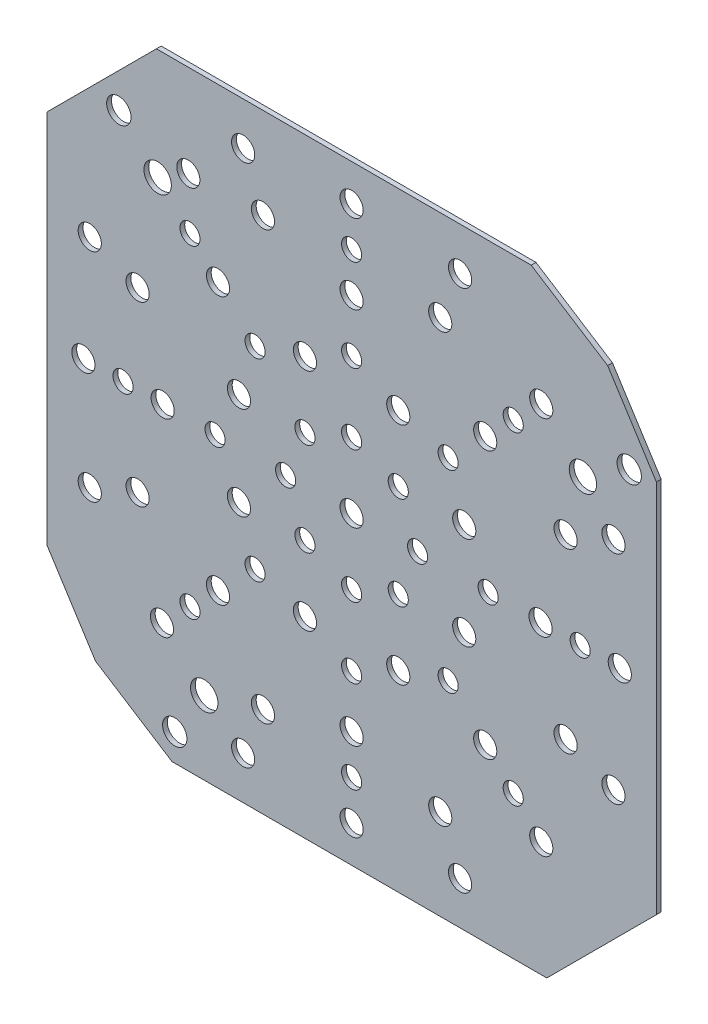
ISO-10303-21;
HEADER;
FILE_DESCRIPTION(('STEP AP214'),'2;1');
FILE_NAME('part.step','',(''),(''),'','','');
FILE_SCHEMA(('AUTOMOTIVE_DESIGN { 1 0 10303 214 1 1 1 1 }'));
ENDSEC;
DATA;
#1=APPLICATION_CONTEXT('core data for automotive mechanical design processes');
#2=APPLICATION_PROTOCOL_DEFINITION('international standard','automotive_design',2000,#1);
#3=PRODUCT_CONTEXT('',#1,'mechanical');
#4=PRODUCT('Part','Part','',(#3));
#5=PRODUCT_RELATED_PRODUCT_CATEGORY('part','',(#4));
#6=PRODUCT_DEFINITION_FORMATION('','',#4);
#7=PRODUCT_DEFINITION_CONTEXT('part definition',#1,'design');
#8=PRODUCT_DEFINITION('design','',#6,#7);
#9=PRODUCT_DEFINITION_SHAPE('','',#8);
#10=(LENGTH_UNIT() NAMED_UNIT(*) SI_UNIT(.MILLI.,.METRE.));
#11=(NAMED_UNIT(*) PLANE_ANGLE_UNIT() SI_UNIT($,.RADIAN.));
#12=(NAMED_UNIT(*) SI_UNIT($,.STERADIAN.) SOLID_ANGLE_UNIT());
#13=UNCERTAINTY_MEASURE_WITH_UNIT(LENGTH_MEASURE(1.E-05),#10,'distance_accuracy_value','');
#14=(GEOMETRIC_REPRESENTATION_CONTEXT(3) GLOBAL_UNCERTAINTY_ASSIGNED_CONTEXT((#13)) GLOBAL_UNIT_ASSIGNED_CONTEXT((#10,
#11,#12)) REPRESENTATION_CONTEXT('',''));
#15=CARTESIAN_POINT('',(0.,0.,0.));
#16=DIRECTION('',(0.,0.,1.));
#17=DIRECTION('',(1.,0.,0.));
#18=AXIS2_PLACEMENT_3D('',#15,#16,#17);
#19=CARTESIAN_POINT('',(-29.5,46.5,-0.8126));
#20=DIRECTION('',(0.,0.,-1.));
#21=DIRECTION('',(-1.,0.,0.));
#22=AXIS2_PLACEMENT_3D('',#19,#20,#21);
#23=PLANE('',#22);
#24=CARTESIAN_POINT('',(-24.1784823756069,-37.9526150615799,-0.812599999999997));
#25=DIRECTION('',(0.,0.,-1.));
#26=DIRECTION('',(-1.,0.,0.));
#27=AXIS2_PLACEMENT_3D('',#24,#25,#26);
#28=CIRCLE('',#27,2.25);
#29=CARTESIAN_POINT('',(-26.4284823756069,-37.9526150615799,-0.812599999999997));
#30=VERTEX_POINT('',#29);
#31=EDGE_CURVE('E1111',#30,#30,#28,.T.);
#32=ORIENTED_EDGE('',*,*,#31,.T.);
#33=EDGE_LOOP('',(#32));
#34=FACE_BOUND('',#33,.T.);
#35=CARTESIAN_POINT('',(-31.8198051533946,31.8198051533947,-0.812599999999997));
#36=DIRECTION('',(0.,0.,-1.));
#37=DIRECTION('',(-1.,0.,0.));
#38=AXIS2_PLACEMENT_3D('',#35,#36,#37);
#39=CIRCLE('',#38,2.25);
#40=CARTESIAN_POINT('',(-34.0698051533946,31.8198051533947,-0.812599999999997));
#41=VERTEX_POINT('',#40);
#42=EDGE_CURVE('E1117',#41,#41,#39,.T.);
#43=ORIENTED_EDGE('',*,*,#42,.T.);
#44=EDGE_LOOP('',(#43));
#45=FACE_BOUND('',#44,.T.);
#46=CARTESIAN_POINT('',(37.9526150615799,24.1784823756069,-0.812599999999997));
#47=DIRECTION('',(0.,0.,-1.));
#48=DIRECTION('',(-1.,0.,0.));
#49=AXIS2_PLACEMENT_3D('',#46,#47,#48);
#50=CIRCLE('',#49,2.25);
#51=CARTESIAN_POINT('',(35.7026150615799,24.1784823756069,-0.812599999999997));
#52=VERTEX_POINT('',#51);
#53=EDGE_CURVE('E1123',#52,#52,#50,.T.);
#54=ORIENTED_EDGE('',*,*,#53,.T.);
#55=EDGE_LOOP('',(#54));
#56=FACE_BOUND('',#55,.T.);
#57=CARTESIAN_POINT('',(-29.0141788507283,-45.5431380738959,-0.812599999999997));
#58=DIRECTION('',(0.,0.,-1.));
#59=DIRECTION('',(-1.,0.,0.));
#60=AXIS2_PLACEMENT_3D('',#57,#58,#59);
#61=CIRCLE('',#60,2.00000000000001);
#62=CARTESIAN_POINT('',(-31.0141788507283,-45.5431380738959,-0.812599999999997));
#63=VERTEX_POINT('',#62);
#64=EDGE_CURVE('E1129',#63,#63,#61,.T.);
#65=ORIENTED_EDGE('',*,*,#64,.T.);
#66=EDGE_LOOP('',(#65));
#67=FACE_BOUND('',#66,.T.);
#68=CARTESIAN_POINT('',(45.5431380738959,29.0141788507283,-0.812599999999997));
#69=DIRECTION('',(0.,0.,-1.));
#70=DIRECTION('',(-1.,0.,0.));
#71=AXIS2_PLACEMENT_3D('',#68,#69,#70);
#72=CIRCLE('',#71,2.);
#73=CARTESIAN_POINT('',(43.5431380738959,29.0141788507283,-0.812599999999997));
#74=VERTEX_POINT('',#73);
#75=EDGE_CURVE('E1135',#74,#74,#72,.T.);
#76=ORIENTED_EDGE('',*,*,#75,.T.);
#77=EDGE_LOOP('',(#76));
#78=FACE_BOUND('',#77,.T.);
#79=CARTESIAN_POINT('',(-38.1837661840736,38.1837661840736,-0.812599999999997));
#80=DIRECTION('',(0.,0.,-1.));
#81=DIRECTION('',(-1.,0.,0.));
#82=AXIS2_PLACEMENT_3D('',#79,#80,#81);
#83=CIRCLE('',#82,2.);
#84=CARTESIAN_POINT('',(-40.1837661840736,38.1837661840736,-0.812599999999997));
#85=VERTEX_POINT('',#84);
#86=EDGE_CURVE('E1141',#85,#85,#83,.T.);
#87=ORIENTED_EDGE('',*,*,#86,.T.);
#88=EDGE_LOOP('',(#87));
#89=FACE_BOUND('',#88,.T.);
#90=CARTESIAN_POINT('',(3.84690109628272E-11,6.51928597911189E-11,-0.8126));
#91=DIRECTION('',(0.,0.,1.));
#92=DIRECTION('',(1.,0.,0.));
#93=AXIS2_PLACEMENT_3D('',#90,#91,#92);
#94=CIRCLE('',#93,1.89999999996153);
#95=CARTESIAN_POINT('',(1.9,6.51928597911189E-11,-0.8126));
#96=VERTEX_POINT('',#95);
#97=EDGE_CURVE('E40',#96,#96,#94,.T.);
#98=ORIENTED_EDGE('',*,*,#97,.F.);
#99=EDGE_LOOP('',(#98));
#100=FACE_BOUND('',#99,.T.);
#101=CARTESIAN_POINT('',(-35.1074222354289,14.5419704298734,-0.8126));
#102=DIRECTION('',(0.,0.,1.));
#103=DIRECTION('',(1.,0.,0.));
#104=AXIS2_PLACEMENT_3D('',#101,#102,#103);
#105=CIRCLE('',#104,1.9);
#106=CARTESIAN_POINT('',(-33.2074222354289,14.5419704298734,-0.8126));
#107=VERTEX_POINT('',#106);
#108=EDGE_CURVE('E525',#107,#107,#105,.T.);
#109=ORIENTED_EDGE('',*,*,#108,.F.);
#110=EDGE_LOOP('',(#109));
#111=FACE_BOUND('',#110,.T.);
#112=CARTESIAN_POINT('',(-7.65366864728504,18.4775906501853,-0.8126));
#113=DIRECTION('',(0.,0.,1.));
#114=DIRECTION('',(1.,0.,0.));
#115=AXIS2_PLACEMENT_3D('',#112,#113,#114);
#116=CIRCLE('',#115,1.9);
#117=CARTESIAN_POINT('',(-5.75366864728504,18.4775906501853,-0.8126));
#118=VERTEX_POINT('',#117);
#119=EDGE_CURVE('E519',#118,#118,#116,.T.);
#120=ORIENTED_EDGE('',*,*,#119,.F.);
#121=EDGE_LOOP('',(#120));
#122=FACE_BOUND('',#121,.T.);
#123=CARTESIAN_POINT('',(7.6536686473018,18.4775906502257,-0.8126));
#124=DIRECTION('',(0.,0.,1.));
#125=DIRECTION('',(1.,0.,0.));
#126=AXIS2_PLACEMENT_3D('',#123,#124,#125);
#127=CIRCLE('',#126,1.9);
#128=CARTESIAN_POINT('',(9.5536686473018,18.4775906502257,-0.8126));
#129=VERTEX_POINT('',#128);
#130=EDGE_CURVE('E513',#129,#129,#127,.T.);
#131=ORIENTED_EDGE('',*,*,#130,.F.);
#132=EDGE_LOOP('',(#131));
#133=FACE_BOUND('',#132,.T.);
#134=CARTESIAN_POINT('',(18.4775906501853,7.65366864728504,-0.8126));
#135=DIRECTION('',(0.,0.,1.));
#136=DIRECTION('',(1.,0.,0.));
#137=AXIS2_PLACEMENT_3D('',#134,#135,#136);
#138=CIRCLE('',#137,1.9);
#139=CARTESIAN_POINT('',(20.3775906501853,7.65366864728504,-0.8126));
#140=VERTEX_POINT('',#139);
#141=EDGE_CURVE('E507',#140,#140,#138,.T.);
#142=ORIENTED_EDGE('',*,*,#141,.F.);
#143=EDGE_LOOP('',(#142));
#144=FACE_BOUND('',#143,.T.);
#145=CARTESIAN_POINT('',(18.4775906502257,-7.6536686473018,-0.8126));
#146=DIRECTION('',(0.,0.,1.));
#147=DIRECTION('',(1.,0.,0.));
#148=AXIS2_PLACEMENT_3D('',#145,#146,#147);
#149=CIRCLE('',#148,1.9);
#150=CARTESIAN_POINT('',(20.3775906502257,-7.6536686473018,-0.8126));
#151=VERTEX_POINT('',#150);
#152=EDGE_CURVE('E501',#151,#151,#149,.T.);
#153=ORIENTED_EDGE('',*,*,#152,.F.);
#154=EDGE_LOOP('',(#153));
#155=FACE_BOUND('',#154,.T.);
#156=CARTESIAN_POINT('',(7.65366864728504,-18.4775906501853,-0.8126));
#157=DIRECTION('',(0.,0.,1.));
#158=DIRECTION('',(1.,0.,0.));
#159=AXIS2_PLACEMENT_3D('',#156,#157,#158);
#160=CIRCLE('',#159,1.9);
#161=CARTESIAN_POINT('',(9.55366864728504,-18.4775906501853,-0.8126));
#162=VERTEX_POINT('',#161);
#163=EDGE_CURVE('E495',#162,#162,#160,.T.);
#164=ORIENTED_EDGE('',*,*,#163,.F.);
#165=EDGE_LOOP('',(#164));
#166=FACE_BOUND('',#165,.T.);
#167=CARTESIAN_POINT('',(-7.6536686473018,-18.4775906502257,-0.8126));
#168=DIRECTION('',(0.,0.,1.));
#169=DIRECTION('',(1.,0.,0.));
#170=AXIS2_PLACEMENT_3D('',#167,#168,#169);
#171=CIRCLE('',#170,1.9);
#172=CARTESIAN_POINT('',(-5.7536686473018,-18.4775906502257,-0.8126));
#173=VERTEX_POINT('',#172);
#174=EDGE_CURVE('E489',#173,#173,#171,.T.);
#175=ORIENTED_EDGE('',*,*,#174,.F.);
#176=EDGE_LOOP('',(#175));
#177=FACE_BOUND('',#176,.T.);
#178=CARTESIAN_POINT('',(-18.4775906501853,-7.65366864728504,-0.8126));
#179=DIRECTION('',(0.,0.,1.));
#180=DIRECTION('',(1.,0.,0.));
#181=AXIS2_PLACEMENT_3D('',#178,#179,#180);
#182=CIRCLE('',#181,1.9);
#183=CARTESIAN_POINT('',(-16.5775906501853,-7.65366864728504,-0.8126));
#184=VERTEX_POINT('',#183);
#185=EDGE_CURVE('E483',#184,#184,#182,.T.);
#186=ORIENTED_EDGE('',*,*,#185,.F.);
#187=EDGE_LOOP('',(#186));
#188=FACE_BOUND('',#187,.T.);
#189=CARTESIAN_POINT('',(-44.0000000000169,-3.20063975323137E-11,-0.8126));
#190=DIRECTION('',(0.,0.,1.));
#191=DIRECTION('',(1.,0.,0.));
#192=AXIS2_PLACEMENT_3D('',#189,#190,#191);
#193=CIRCLE('',#192,1.9);
#194=CARTESIAN_POINT('',(-42.1000000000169,-3.20063975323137E-11,-0.8126));
#195=VERTEX_POINT('',#194);
#196=EDGE_CURVE('E477',#195,#195,#193,.T.);
#197=ORIENTED_EDGE('',*,*,#196,.F.);
#198=EDGE_LOOP('',(#197));
#199=FACE_BOUND('',#198,.T.);
#200=CARTESIAN_POINT('',(-21.9203102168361,21.9203102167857,-0.8126));
#201=DIRECTION('',(0.,0.,1.));
#202=DIRECTION('',(1.,0.,0.));
#203=AXIS2_PLACEMENT_3D('',#200,#201,#202);
#204=CIRCLE('',#203,1.9);
#205=CARTESIAN_POINT('',(-20.0203102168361,21.9203102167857,-0.8126));
#206=VERTEX_POINT('',#205);
#207=EDGE_CURVE('E471',#206,#206,#204,.T.);
#208=ORIENTED_EDGE('',*,*,#207,.F.);
#209=EDGE_LOOP('',(#208));
#210=FACE_BOUND('',#209,.T.);
#211=CARTESIAN_POINT('',(-3.20063975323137E-11,44.0000000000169,-0.8126));
#212=DIRECTION('',(0.,0.,1.));
#213=DIRECTION('',(1.,0.,0.));
#214=AXIS2_PLACEMENT_3D('',#211,#212,#213);
#215=CIRCLE('',#214,1.9);
#216=CARTESIAN_POINT('',(1.89999999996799,44.0000000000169,-0.8126));
#217=VERTEX_POINT('',#216);
#218=EDGE_CURVE('E465',#217,#217,#215,.T.);
#219=ORIENTED_EDGE('',*,*,#218,.F.);
#220=EDGE_LOOP('',(#219));
#221=FACE_BOUND('',#220,.T.);
#222=CARTESIAN_POINT('',(31.1126983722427,31.1126983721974,-0.8126));
#223=DIRECTION('',(0.,0.,1.));
#224=DIRECTION('',(1.,0.,0.));
#225=AXIS2_PLACEMENT_3D('',#222,#223,#224);
#226=CIRCLE('',#225,1.9);
#227=CARTESIAN_POINT('',(33.0126983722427,31.1126983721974,-0.8126));
#228=VERTEX_POINT('',#227);
#229=EDGE_CURVE('E459',#228,#228,#226,.T.);
#230=ORIENTED_EDGE('',*,*,#229,.F.);
#231=EDGE_LOOP('',(#230));
#232=FACE_BOUND('',#231,.T.);
#233=CARTESIAN_POINT('',(44.0000000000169,3.20063975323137E-11,-0.8126));
#234=DIRECTION('',(0.,0.,1.));
#235=DIRECTION('',(1.,0.,0.));
#236=AXIS2_PLACEMENT_3D('',#233,#234,#235);
#237=CIRCLE('',#236,1.9);
#238=CARTESIAN_POINT('',(45.9000000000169,3.20063975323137E-11,-0.8126));
#239=VERTEX_POINT('',#238);
#240=EDGE_CURVE('E453',#239,#239,#237,.T.);
#241=ORIENTED_EDGE('',*,*,#240,.F.);
#242=EDGE_LOOP('',(#241));
#243=FACE_BOUND('',#242,.T.);
#244=CARTESIAN_POINT('',(31.1126983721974,-31.1126983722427,-0.8126));
#245=DIRECTION('',(0.,0.,1.));
#246=DIRECTION('',(1.,0.,0.));
#247=AXIS2_PLACEMENT_3D('',#244,#245,#246);
#248=CIRCLE('',#247,1.9);
#249=CARTESIAN_POINT('',(33.0126983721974,-31.1126983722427,-0.8126));
#250=VERTEX_POINT('',#249);
#251=EDGE_CURVE('E447',#250,#250,#248,.T.);
#252=ORIENTED_EDGE('',*,*,#251,.F.);
#253=EDGE_LOOP('',(#252));
#254=FACE_BOUND('',#253,.T.);
#255=CARTESIAN_POINT('',(3.20063975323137E-11,-44.0000000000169,-0.8126));
#256=DIRECTION('',(0.,0.,1.));
#257=DIRECTION('',(1.,0.,0.));
#258=AXIS2_PLACEMENT_3D('',#255,#256,#257);
#259=CIRCLE('',#258,1.9);
#260=CARTESIAN_POINT('',(1.90000000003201,-44.0000000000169,-0.8126));
#261=VERTEX_POINT('',#260);
#262=EDGE_CURVE('E441',#261,#261,#259,.T.);
#263=ORIENTED_EDGE('',*,*,#262,.F.);
#264=EDGE_LOOP('',(#263));
#265=FACE_BOUND('',#264,.T.);
#266=CARTESIAN_POINT('',(-31.1126983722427,-31.1126983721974,-0.8126));
#267=DIRECTION('',(0.,0.,1.));
#268=DIRECTION('',(1.,0.,0.));
#269=AXIS2_PLACEMENT_3D('',#266,#267,#268);
#270=CIRCLE('',#269,1.9);
#271=CARTESIAN_POINT('',(-29.2126983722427,-31.1126983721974,-0.8126));
#272=VERTEX_POINT('',#271);
#273=EDGE_CURVE('E435',#272,#272,#270,.T.);
#274=ORIENTED_EDGE('',*,*,#273,.F.);
#275=EDGE_LOOP('',(#274));
#276=FACE_BOUND('',#275,.T.);
#277=CARTESIAN_POINT('',(17.7947796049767,42.9603982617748,-0.8126));
#278=DIRECTION('',(0.,0.,1.));
#279=DIRECTION('',(1.,0.,0.));
#280=AXIS2_PLACEMENT_3D('',#277,#278,#279);
#281=CIRCLE('',#280,1.9);
#282=CARTESIAN_POINT('',(19.6947796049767,42.9603982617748,-0.8126));
#283=VERTEX_POINT('',#282);
#284=EDGE_CURVE('E429',#283,#283,#281,.T.);
#285=ORIENTED_EDGE('',*,*,#284,.F.);
#286=EDGE_LOOP('',(#285));
#287=FACE_BOUND('',#286,.T.);
#288=CARTESIAN_POINT('',(42.9603982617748,-17.7947796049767,-0.8126));
#289=DIRECTION('',(0.,0.,1.));
#290=DIRECTION('',(1.,0.,0.));
#291=AXIS2_PLACEMENT_3D('',#288,#289,#290);
#292=CIRCLE('',#291,1.90000000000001);
#293=CARTESIAN_POINT('',(44.8603982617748,-17.7947796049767,-0.8126));
#294=VERTEX_POINT('',#293);
#295=EDGE_CURVE('E423',#294,#294,#292,.T.);
#296=ORIENTED_EDGE('',*,*,#295,.F.);
#297=EDGE_LOOP('',(#296));
#298=FACE_BOUND('',#297,.T.);
#299=CARTESIAN_POINT('',(-17.7947796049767,-42.9603982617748,-0.8126));
#300=DIRECTION('',(0.,0.,1.));
#301=DIRECTION('',(1.,0.,0.));
#302=AXIS2_PLACEMENT_3D('',#299,#300,#301);
#303=CIRCLE('',#302,1.90000000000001);
#304=CARTESIAN_POINT('',(-15.8947796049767,-42.9603982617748,-0.8126));
#305=VERTEX_POINT('',#304);
#306=EDGE_CURVE('E417',#305,#305,#303,.T.);
#307=ORIENTED_EDGE('',*,*,#306,.F.);
#308=EDGE_LOOP('',(#307));
#309=FACE_BOUND('',#308,.T.);
#310=CARTESIAN_POINT('',(-26.7855028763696,34.9075469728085,-0.8126));
#311=DIRECTION('',(0.,0.,1.));
#312=DIRECTION('',(1.,0.,0.));
#313=AXIS2_PLACEMENT_3D('',#310,#311,#312);
#314=CIRCLE('',#313,1.89999999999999);
#315=CARTESIAN_POINT('',(-24.8855028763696,34.9075469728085,-0.8126));
#316=VERTEX_POINT('',#315);
#317=EDGE_CURVE('E411',#316,#316,#314,.T.);
#318=ORIENTED_EDGE('',*,*,#317,.F.);
#319=EDGE_LOOP('',(#318));
#320=FACE_BOUND('',#319,.T.);
#321=CARTESIAN_POINT('',(-42.9603982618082,-17.7947796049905,-0.8126));
#322=DIRECTION('',(0.,0.,1.));
#323=DIRECTION('',(1.,0.,0.));
#324=AXIS2_PLACEMENT_3D('',#321,#322,#323);
#325=CIRCLE('',#324,1.9);
#326=CARTESIAN_POINT('',(-41.0603982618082,-17.7947796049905,-0.8126));
#327=VERTEX_POINT('',#326);
#328=EDGE_CURVE('E405',#327,#327,#325,.T.);
#329=ORIENTED_EDGE('',*,*,#328,.F.);
#330=EDGE_LOOP('',(#329));
#331=FACE_BOUND('',#330,.T.);
#332=CARTESIAN_POINT('',(17.7947796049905,-42.9603982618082,-0.8126));
#333=DIRECTION('',(0.,0.,1.));
#334=DIRECTION('',(1.,0.,0.));
#335=AXIS2_PLACEMENT_3D('',#332,#333,#334);
#336=CIRCLE('',#335,1.90000000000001);
#337=CARTESIAN_POINT('',(19.6947796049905,-42.9603982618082,-0.8126));
#338=VERTEX_POINT('',#337);
#339=EDGE_CURVE('E399',#338,#338,#336,.T.);
#340=ORIENTED_EDGE('',*,*,#339,.F.);
#341=EDGE_LOOP('',(#340));
#342=FACE_BOUND('',#341,.T.);
#343=CARTESIAN_POINT('',(42.9603982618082,17.7947796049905,-0.8126));
#344=DIRECTION('',(0.,0.,1.));
#345=DIRECTION('',(1.,0.,0.));
#346=AXIS2_PLACEMENT_3D('',#343,#344,#345);
#347=CIRCLE('',#346,1.90000000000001);
#348=CARTESIAN_POINT('',(44.8603982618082,17.7947796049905,-0.8126));
#349=VERTEX_POINT('',#348);
#350=EDGE_CURVE('E393',#349,#349,#347,.T.);
#351=ORIENTED_EDGE('',*,*,#350,.F.);
#352=EDGE_LOOP('',(#351));
#353=FACE_BOUND('',#352,.T.);
#354=CARTESIAN_POINT('',(-17.7947796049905,42.9603982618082,-0.8126));
#355=DIRECTION('',(0.,0.,1.));
#356=DIRECTION('',(1.,0.,0.));
#357=AXIS2_PLACEMENT_3D('',#354,#355,#356);
#358=CIRCLE('',#357,1.90000000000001);
#359=CARTESIAN_POINT('',(-15.8947796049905,42.9603982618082,-0.8126));
#360=VERTEX_POINT('',#359);
#361=EDGE_CURVE('E387',#360,#360,#358,.T.);
#362=ORIENTED_EDGE('',*,*,#361,.F.);
#363=EDGE_LOOP('',(#362));
#364=FACE_BOUND('',#363,.T.);
#365=CARTESIAN_POINT('',(-21.9203102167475,-21.9203102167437,-0.8126));
#366=DIRECTION('',(0.,0.,1.));
#367=DIRECTION('',(1.,0.,0.));
#368=AXIS2_PLACEMENT_3D('',#365,#366,#367);
#369=CIRCLE('',#368,1.9);
#370=CARTESIAN_POINT('',(-20.0203102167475,-21.9203102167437,-0.8126));
#371=VERTEX_POINT('',#370);
#372=EDGE_CURVE('E381',#371,#371,#369,.T.);
#373=ORIENTED_EDGE('',*,*,#372,.F.);
#374=EDGE_LOOP('',(#373));
#375=FACE_BOUND('',#374,.T.);
#376=CARTESIAN_POINT('',(2.65920618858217E-12,-30.9999999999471,-0.8126));
#377=DIRECTION('',(0.,0.,1.));
#378=DIRECTION('',(1.,0.,0.));
#379=AXIS2_PLACEMENT_3D('',#376,#377,#378);
#380=CIRCLE('',#379,1.9);
#381=CARTESIAN_POINT('',(1.90000000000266,-30.9999999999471,-0.8126));
#382=VERTEX_POINT('',#381);
#383=EDGE_CURVE('E375',#382,#382,#380,.T.);
#384=ORIENTED_EDGE('',*,*,#383,.F.);
#385=EDGE_LOOP('',(#384));
#386=FACE_BOUND('',#385,.T.);
#387=CARTESIAN_POINT('',(21.9203102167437,-21.9203102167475,-0.8126));
#388=DIRECTION('',(0.,0.,1.));
#389=DIRECTION('',(1.,0.,0.));
#390=AXIS2_PLACEMENT_3D('',#387,#388,#389);
#391=CIRCLE('',#390,1.9);
#392=CARTESIAN_POINT('',(23.8203102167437,-21.9203102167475,-0.8126));
#393=VERTEX_POINT('',#392);
#394=EDGE_CURVE('E369',#393,#393,#391,.T.);
#395=ORIENTED_EDGE('',*,*,#394,.F.);
#396=EDGE_LOOP('',(#395));
#397=FACE_BOUND('',#396,.T.);
#398=CARTESIAN_POINT('',(30.9999999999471,2.65920618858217E-12,-0.8126));
#399=DIRECTION('',(0.,0.,1.));
#400=DIRECTION('',(1.,0.,0.));
#401=AXIS2_PLACEMENT_3D('',#398,#399,#400);
#402=CIRCLE('',#401,1.9);
#403=CARTESIAN_POINT('',(32.8999999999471,2.65920618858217E-12,-0.8126));
#404=VERTEX_POINT('',#403);
#405=EDGE_CURVE('E363',#404,#404,#402,.T.);
#406=ORIENTED_EDGE('',*,*,#405,.F.);
#407=EDGE_LOOP('',(#406));
#408=FACE_BOUND('',#407,.T.);
#409=CARTESIAN_POINT('',(21.9203102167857,21.9203102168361,-0.8126));
#410=DIRECTION('',(0.,0.,1.));
#411=DIRECTION('',(1.,0.,0.));
#412=AXIS2_PLACEMENT_3D('',#409,#410,#411);
#413=CIRCLE('',#412,1.9);
#414=CARTESIAN_POINT('',(23.8203102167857,21.9203102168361,-0.8126));
#415=VERTEX_POINT('',#414);
#416=EDGE_CURVE('E357',#415,#415,#413,.T.);
#417=ORIENTED_EDGE('',*,*,#416,.F.);
#418=EDGE_LOOP('',(#417));
#419=FACE_BOUND('',#418,.T.);
#420=CARTESIAN_POINT('',(3.56106255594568E-11,31.0000000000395,-0.8126));
#421=DIRECTION('',(0.,0.,1.));
#422=DIRECTION('',(1.,0.,0.));
#423=AXIS2_PLACEMENT_3D('',#420,#421,#422);
#424=CIRCLE('',#423,1.9);
#425=CARTESIAN_POINT('',(1.90000000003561,31.0000000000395,-0.8126));
#426=VERTEX_POINT('',#425);
#427=EDGE_CURVE('E351',#426,#426,#424,.T.);
#428=ORIENTED_EDGE('',*,*,#427,.F.);
#429=EDGE_LOOP('',(#428));
#430=FACE_BOUND('',#429,.T.);
#431=CARTESIAN_POINT('',(-42.9603982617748,17.7947796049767,-0.8126));
#432=DIRECTION('',(0.,0.,1.));
#433=DIRECTION('',(1.,0.,0.));
#434=AXIS2_PLACEMENT_3D('',#431,#432,#433);
#435=CIRCLE('',#434,1.9);
#436=CARTESIAN_POINT('',(-41.0603982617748,17.7947796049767,-0.8126));
#437=VERTEX_POINT('',#436);
#438=EDGE_CURVE('E345',#437,#437,#435,.T.);
#439=ORIENTED_EDGE('',*,*,#438,.F.);
#440=EDGE_LOOP('',(#439));
#441=FACE_BOUND('',#440,.T.);
#442=CARTESIAN_POINT('',(-35.1074222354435,-14.5419704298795,-0.8126));
#443=DIRECTION('',(0.,0.,1.));
#444=DIRECTION('',(1.,0.,0.));
#445=AXIS2_PLACEMENT_3D('',#442,#443,#444);
#446=CIRCLE('',#445,1.9);
#447=CARTESIAN_POINT('',(-33.2074222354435,-14.5419704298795,-0.8126));
#448=VERTEX_POINT('',#447);
#449=EDGE_CURVE('E339',#448,#448,#446,.T.);
#450=ORIENTED_EDGE('',*,*,#449,.F.);
#451=EDGE_LOOP('',(#450));
#452=FACE_BOUND('',#451,.T.);
#453=CARTESIAN_POINT('',(-14.5419704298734,-35.1074222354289,-0.8126));
#454=DIRECTION('',(0.,0.,1.));
#455=DIRECTION('',(1.,0.,0.));
#456=AXIS2_PLACEMENT_3D('',#453,#454,#455);
#457=CIRCLE('',#456,1.9);
#458=CARTESIAN_POINT('',(-12.6419704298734,-35.1074222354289,-0.8126));
#459=VERTEX_POINT('',#458);
#460=EDGE_CURVE('E333',#459,#459,#457,.T.);
#461=ORIENTED_EDGE('',*,*,#460,.F.);
#462=EDGE_LOOP('',(#461));
#463=FACE_BOUND('',#462,.T.);
#464=CARTESIAN_POINT('',(14.5419704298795,-35.1074222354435,-0.8126));
#465=DIRECTION('',(0.,0.,1.));
#466=DIRECTION('',(1.,0.,0.));
#467=AXIS2_PLACEMENT_3D('',#464,#465,#466);
#468=CIRCLE('',#467,1.9);
#469=CARTESIAN_POINT('',(16.4419704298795,-35.1074222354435,-0.8126));
#470=VERTEX_POINT('',#469);
#471=EDGE_CURVE('E327',#470,#470,#468,.T.);
#472=ORIENTED_EDGE('',*,*,#471,.F.);
#473=EDGE_LOOP('',(#472));
#474=FACE_BOUND('',#473,.T.);
#475=CARTESIAN_POINT('',(35.1074222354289,-14.5419704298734,-0.8126));
#476=DIRECTION('',(0.,0.,1.));
#477=DIRECTION('',(1.,0.,0.));
#478=AXIS2_PLACEMENT_3D('',#475,#476,#477);
#479=CIRCLE('',#478,1.9);
#480=CARTESIAN_POINT('',(37.0074222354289,-14.5419704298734,-0.8126));
#481=VERTEX_POINT('',#480);
#482=EDGE_CURVE('E321',#481,#481,#479,.T.);
#483=ORIENTED_EDGE('',*,*,#482,.F.);
#484=EDGE_LOOP('',(#483));
#485=FACE_BOUND('',#484,.T.);
#486=CARTESIAN_POINT('',(35.1074222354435,14.5419704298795,-0.8126));
#487=DIRECTION('',(0.,0.,1.));
#488=DIRECTION('',(1.,0.,0.));
#489=AXIS2_PLACEMENT_3D('',#486,#487,#488);
#490=CIRCLE('',#489,1.9);
#491=CARTESIAN_POINT('',(37.0074222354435,14.5419704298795,-0.8126));
#492=VERTEX_POINT('',#491);
#493=EDGE_CURVE('E315',#492,#492,#490,.T.);
#494=ORIENTED_EDGE('',*,*,#493,.F.);
#495=EDGE_LOOP('',(#494));
#496=FACE_BOUND('',#495,.T.);
#497=CARTESIAN_POINT('',(14.5419704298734,35.1074222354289,-0.8126));
#498=DIRECTION('',(0.,0.,1.));
#499=DIRECTION('',(1.,0.,0.));
#500=AXIS2_PLACEMENT_3D('',#497,#498,#499);
#501=CIRCLE('',#500,1.9);
#502=CARTESIAN_POINT('',(16.4419704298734,35.1074222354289,-0.8126));
#503=VERTEX_POINT('',#502);
#504=EDGE_CURVE('E309',#503,#503,#501,.T.);
#505=ORIENTED_EDGE('',*,*,#504,.F.);
#506=EDGE_LOOP('',(#505));
#507=FACE_BOUND('',#506,.T.);
#508=CARTESIAN_POINT('',(-14.5419704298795,35.1074222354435,-0.8126));
#509=DIRECTION('',(0.,0.,1.));
#510=DIRECTION('',(1.,0.,0.));
#511=AXIS2_PLACEMENT_3D('',#508,#509,#510);
#512=CIRCLE('',#511,1.9);
#513=CARTESIAN_POINT('',(-12.6419704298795,35.1074222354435,-0.8126));
#514=VERTEX_POINT('',#513);
#515=EDGE_CURVE('E303',#514,#514,#512,.T.);
#516=ORIENTED_EDGE('',*,*,#515,.F.);
#517=EDGE_LOOP('',(#516));
#518=FACE_BOUND('',#517,.T.);
#519=CARTESIAN_POINT('',(-30.9999999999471,-2.65920618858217E-12,-0.8126));
#520=DIRECTION('',(0.,0.,1.));
#521=DIRECTION('',(1.,0.,0.));
#522=AXIS2_PLACEMENT_3D('',#519,#520,#521);
#523=CIRCLE('',#522,1.9);
#524=CARTESIAN_POINT('',(-29.0999999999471,-2.65920618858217E-12,-0.8126));
#525=VERTEX_POINT('',#524);
#526=EDGE_CURVE('E297',#525,#525,#523,.T.);
#527=ORIENTED_EDGE('',*,*,#526,.F.);
#528=EDGE_LOOP('',(#527));
#529=FACE_BOUND('',#528,.T.);
#530=CARTESIAN_POINT('',(-18.4775906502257,7.6536686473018,-0.8126));
#531=DIRECTION('',(0.,0.,1.));
#532=DIRECTION('',(1.,0.,0.));
#533=AXIS2_PLACEMENT_3D('',#530,#531,#532);
#534=CIRCLE('',#533,1.9);
#535=CARTESIAN_POINT('',(-16.5775906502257,7.6536686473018,-0.8126));
#536=VERTEX_POINT('',#535);
#537=EDGE_CURVE('E291',#536,#536,#534,.T.);
#538=ORIENTED_EDGE('',*,*,#537,.F.);
#539=EDGE_LOOP('',(#538));
#540=FACE_BOUND('',#539,.T.);
#541=CARTESIAN_POINT('',(10.8239220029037,-8.37788199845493E-12,-0.8126));
#542=DIRECTION('',(0.,0.,1.));
#543=DIRECTION('',(1.,0.,0.));
#544=AXIS2_PLACEMENT_3D('',#541,#542,#543);
#545=CIRCLE('',#544,1.65);
#546=CARTESIAN_POINT('',(12.4739220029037,-8.37788199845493E-12,-0.8126));
#547=VERTEX_POINT('',#546);
#548=EDGE_CURVE('E285',#547,#547,#545,.T.);
#549=ORIENTED_EDGE('',*,*,#548,.F.);
#550=EDGE_LOOP('',(#549));
#551=FACE_BOUND('',#550,.T.);
#552=CARTESIAN_POINT('',(15.8390806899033,15.8390806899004,-0.8126));
#553=DIRECTION('',(0.,0.,1.));
#554=DIRECTION('',(1.,0.,0.));
#555=AXIS2_PLACEMENT_3D('',#552,#553,#554);
#556=CIRCLE('',#555,1.65);
#557=CARTESIAN_POINT('',(17.4890806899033,15.8390806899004,-0.8126));
#558=VERTEX_POINT('',#557);
#559=EDGE_CURVE('E279',#558,#558,#556,.T.);
#560=ORIENTED_EDGE('',*,*,#559,.F.);
#561=EDGE_LOOP('',(#560));
#562=FACE_BOUND('',#561,.T.);
#563=CARTESIAN_POINT('',(0.,37.5000000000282,-0.8126));
#564=DIRECTION('',(0.,0.,1.));
#565=DIRECTION('',(1.,0.,0.));
#566=AXIS2_PLACEMENT_3D('',#563,#564,#565);
#567=CIRCLE('',#566,1.65);
#568=CARTESIAN_POINT('',(1.65,37.5000000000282,-0.8126));
#569=VERTEX_POINT('',#568);
#570=EDGE_CURVE('E273',#569,#569,#567,.T.);
#571=ORIENTED_EDGE('',*,*,#570,.F.);
#572=EDGE_LOOP('',(#571));
#573=FACE_BOUND('',#572,.T.);
#574=CARTESIAN_POINT('',(7.65366864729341,7.65366864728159,-0.8126));
#575=DIRECTION('',(0.,0.,1.));
#576=DIRECTION('',(0.707106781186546,0.707106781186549,0.));
#577=AXIS2_PLACEMENT_3D('',#574,#575,#576);
#578=CIRCLE('',#577,1.65);
#579=CARTESIAN_POINT('',(8.82039483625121,8.8203948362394,-0.8126));
#580=VERTEX_POINT('',#579);
#581=EDGE_CURVE('E267',#580,#580,#578,.T.);
#582=ORIENTED_EDGE('',*,*,#581,.F.);
#583=EDGE_LOOP('',(#582));
#584=FACE_BOUND('',#583,.T.);
#585=CARTESIAN_POINT('',(1.95503335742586E-12,22.399842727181,-0.8126));
#586=DIRECTION('',(0.,0.,1.));
#587=DIRECTION('',(0.707106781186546,0.707106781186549,0.));
#588=AXIS2_PLACEMENT_3D('',#585,#586,#587);
#589=CIRCLE('',#588,1.65);
#590=CARTESIAN_POINT('',(1.16672618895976,23.5665689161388,-0.8126));
#591=VERTEX_POINT('',#590);
#592=EDGE_CURVE('E261',#591,#591,#589,.T.);
#593=ORIENTED_EDGE('',*,*,#592,.F.);
#594=EDGE_LOOP('',(#593));
#595=FACE_BOUND('',#594,.T.);
#596=CARTESIAN_POINT('',(-26.5165042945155,26.5165042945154,-0.8126));
#597=DIRECTION('',(0.,0.,1.));
#598=DIRECTION('',(0.707106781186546,0.707106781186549,0.));
#599=AXIS2_PLACEMENT_3D('',#596,#597,#598);
#600=CIRCLE('',#599,1.65);
#601=CARTESIAN_POINT('',(-25.3497781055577,27.6832304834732,-0.8126));
#602=VERTEX_POINT('',#601);
#603=EDGE_CURVE('E255',#602,#602,#600,.T.);
#604=ORIENTED_EDGE('',*,*,#603,.F.);
#605=EDGE_LOOP('',(#604));
#606=FACE_BOUND('',#605,.T.);
#607=CARTESIAN_POINT('',(8.3400904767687E-12,10.8239220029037,-0.8126));
#608=DIRECTION('',(0.,0.,1.));
#609=DIRECTION('',(0.,1.,0.));
#610=AXIS2_PLACEMENT_3D('',#607,#608,#609);
#611=CIRCLE('',#610,1.65);
#612=CARTESIAN_POINT('',(8.33432953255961E-12,12.4739220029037,-0.8126));
#613=VERTEX_POINT('',#612);
#614=EDGE_CURVE('E249',#613,#613,#611,.T.);
#615=ORIENTED_EDGE('',*,*,#614,.F.);
#616=EDGE_LOOP('',(#615));
#617=FACE_BOUND('',#616,.T.);
#618=CARTESIAN_POINT('',(-15.8390806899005,15.8390806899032,-0.8126));
#619=DIRECTION('',(0.,0.,1.));
#620=DIRECTION('',(0.,1.,0.));
#621=AXIS2_PLACEMENT_3D('',#618,#619,#620);
#622=CIRCLE('',#621,1.65);
#623=CARTESIAN_POINT('',(-15.8390806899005,17.4890806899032,-0.8126));
#624=VERTEX_POINT('',#623);
#625=EDGE_CURVE('E243',#624,#624,#622,.T.);
#626=ORIENTED_EDGE('',*,*,#625,.F.);
#627=EDGE_LOOP('',(#626));
#628=FACE_BOUND('',#627,.T.);
#629=CARTESIAN_POINT('',(-37.5000000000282,-1.30930550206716E-13,-0.8126));
#630=DIRECTION('',(0.,0.,1.));
#631=DIRECTION('',(0.,1.,0.));
#632=AXIS2_PLACEMENT_3D('',#629,#630,#631);
#633=CIRCLE('',#632,1.65);
#634=CARTESIAN_POINT('',(-37.5000000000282,1.64999999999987,-0.8126));
#635=VERTEX_POINT('',#634);
#636=EDGE_CURVE('E237',#635,#635,#633,.T.);
#637=ORIENTED_EDGE('',*,*,#636,.F.);
#638=EDGE_LOOP('',(#637));
#639=FACE_BOUND('',#638,.T.);
#640=CARTESIAN_POINT('',(-7.65366864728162,7.65366864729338,-0.8126));
#641=DIRECTION('',(0.,0.,1.));
#642=DIRECTION('',(-0.707106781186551,0.707106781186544,0.));
#643=AXIS2_PLACEMENT_3D('',#640,#641,#642);
#644=CIRCLE('',#643,1.65);
#645=CARTESIAN_POINT('',(-8.82039483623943,8.82039483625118,-0.8126));
#646=VERTEX_POINT('',#645);
#647=EDGE_CURVE('E231',#646,#646,#644,.T.);
#648=ORIENTED_EDGE('',*,*,#647,.F.);
#649=EDGE_LOOP('',(#648));
#650=FACE_BOUND('',#649,.T.);
#651=CARTESIAN_POINT('',(-22.399842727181,1.87350135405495E-12,-0.8126));
#652=DIRECTION('',(0.,0.,1.));
#653=DIRECTION('',(-0.707106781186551,0.707106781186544,0.));
#654=AXIS2_PLACEMENT_3D('',#651,#652,#653);
#655=CIRCLE('',#654,1.65);
#656=CARTESIAN_POINT('',(-23.5665689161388,1.16672618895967,-0.8126));
#657=VERTEX_POINT('',#656);
#658=EDGE_CURVE('E225',#657,#657,#655,.T.);
#659=ORIENTED_EDGE('',*,*,#658,.F.);
#660=EDGE_LOOP('',(#659));
#661=FACE_BOUND('',#660,.T.);
#662=CARTESIAN_POINT('',(-26.5165042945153,-26.5165042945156,-0.8126));
#663=DIRECTION('',(0.,0.,1.));
#664=DIRECTION('',(-0.707106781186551,0.707106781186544,0.));
#665=AXIS2_PLACEMENT_3D('',#662,#663,#664);
#666=CIRCLE('',#665,1.65);
#667=CARTESIAN_POINT('',(-27.6832304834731,-25.3497781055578,-0.8126));
#668=VERTEX_POINT('',#667);
#669=EDGE_CURVE('E219',#668,#668,#666,.T.);
#670=ORIENTED_EDGE('',*,*,#669,.F.);
#671=EDGE_LOOP('',(#670));
#672=FACE_BOUND('',#671,.T.);
#673=CARTESIAN_POINT('',(-10.8239220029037,8.37788199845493E-12,-0.8126));
#674=DIRECTION('',(0.,0.,1.));
#675=DIRECTION('',(-1.,0.,0.));
#676=AXIS2_PLACEMENT_3D('',#673,#674,#675);
#677=CIRCLE('',#676,1.65);
#678=CARTESIAN_POINT('',(-12.4739220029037,8.37788199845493E-12,-0.8126));
#679=VERTEX_POINT('',#678);
#680=EDGE_CURVE('E213',#679,#679,#677,.T.);
#681=ORIENTED_EDGE('',*,*,#680,.F.);
#682=EDGE_LOOP('',(#681));
#683=FACE_BOUND('',#682,.T.);
#684=CARTESIAN_POINT('',(-15.8390806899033,-15.8390806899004,-0.8126));
#685=DIRECTION('',(0.,0.,1.));
#686=DIRECTION('',(-1.,0.,0.));
#687=AXIS2_PLACEMENT_3D('',#684,#685,#686);
#688=CIRCLE('',#687,1.65);
#689=CARTESIAN_POINT('',(-17.4890806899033,-15.8390806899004,-0.8126));
#690=VERTEX_POINT('',#689);
#691=EDGE_CURVE('E207',#690,#690,#688,.T.);
#692=ORIENTED_EDGE('',*,*,#691,.F.);
#693=EDGE_LOOP('',(#692));
#694=FACE_BOUND('',#693,.T.);
#695=CARTESIAN_POINT('',(0.,-37.5000000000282,-0.8126));
#696=DIRECTION('',(0.,0.,1.));
#697=DIRECTION('',(-1.,0.,0.));
#698=AXIS2_PLACEMENT_3D('',#695,#696,#697);
#699=CIRCLE('',#698,1.65);
#700=CARTESIAN_POINT('',(-1.65,-37.5000000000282,-0.8126));
#701=VERTEX_POINT('',#700);
#702=EDGE_CURVE('E201',#701,#701,#699,.T.);
#703=ORIENTED_EDGE('',*,*,#702,.F.);
#704=EDGE_LOOP('',(#703));
#705=FACE_BOUND('',#704,.T.);
#706=CARTESIAN_POINT('',(-7.65366864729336,-7.65366864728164,-0.8126));
#707=DIRECTION('',(0.,0.,1.));
#708=DIRECTION('',(-0.707106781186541,-0.707106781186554,0.));
#709=AXIS2_PLACEMENT_3D('',#706,#707,#708);
#710=CIRCLE('',#709,1.65);
#711=CARTESIAN_POINT('',(-8.82039483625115,-8.82039483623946,-0.8126));
#712=VERTEX_POINT('',#711);
#713=EDGE_CURVE('E195',#712,#712,#710,.T.);
#714=ORIENTED_EDGE('',*,*,#713,.F.);
#715=EDGE_LOOP('',(#714));
#716=FACE_BOUND('',#715,.T.);
#717=CARTESIAN_POINT('',(-1.79717352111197E-12,-22.399842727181,-0.8126));
#718=DIRECTION('',(0.,0.,1.));
#719=DIRECTION('',(-0.707106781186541,-0.707106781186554,0.));
#720=AXIS2_PLACEMENT_3D('',#717,#718,#719);
#721=CIRCLE('',#720,1.65);
#722=CARTESIAN_POINT('',(-1.16672618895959,-23.5665689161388,-0.8126));
#723=VERTEX_POINT('',#722);
#724=EDGE_CURVE('E189',#723,#723,#721,.T.);
#725=ORIENTED_EDGE('',*,*,#724,.F.);
#726=EDGE_LOOP('',(#725));
#727=FACE_BOUND('',#726,.T.);
#728=CARTESIAN_POINT('',(26.5165042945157,-26.5165042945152,-0.8126));
#729=DIRECTION('',(0.,0.,1.));
#730=DIRECTION('',(-0.707106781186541,-0.707106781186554,0.));
#731=AXIS2_PLACEMENT_3D('',#728,#729,#730);
#732=CIRCLE('',#731,1.65);
#733=CARTESIAN_POINT('',(25.3497781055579,-27.6832304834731,-0.8126));
#734=VERTEX_POINT('',#733);
#735=EDGE_CURVE('E183',#734,#734,#732,.T.);
#736=ORIENTED_EDGE('',*,*,#735,.F.);
#737=EDGE_LOOP('',(#736));
#738=FACE_BOUND('',#737,.T.);
#739=CARTESIAN_POINT('',(-8.26450743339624E-12,-10.8239220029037,-0.8126));
#740=DIRECTION('',(0.,0.,1.));
#741=DIRECTION('',(0.,-1.,0.));
#742=AXIS2_PLACEMENT_3D('',#739,#740,#741);
#743=CIRCLE('',#742,1.65);
#744=CARTESIAN_POINT('',(-8.24722460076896E-12,-12.4739220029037,-0.8126));
#745=VERTEX_POINT('',#744);
#746=EDGE_CURVE('E177',#745,#745,#743,.T.);
#747=ORIENTED_EDGE('',*,*,#746,.F.);
#748=EDGE_LOOP('',(#747));
#749=FACE_BOUND('',#748,.T.);
#750=CARTESIAN_POINT('',(15.8390806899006,-15.8390806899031,-0.8126));
#751=DIRECTION('',(0.,0.,1.));
#752=DIRECTION('',(0.,-1.,0.));
#753=AXIS2_PLACEMENT_3D('',#750,#751,#752);
#754=CIRCLE('',#753,1.65);
#755=CARTESIAN_POINT('',(15.8390806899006,-17.4890806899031,-0.8126));
#756=VERTEX_POINT('',#755);
#757=EDGE_CURVE('E171',#756,#756,#754,.T.);
#758=ORIENTED_EDGE('',*,*,#757,.F.);
#759=EDGE_LOOP('',(#758));
#760=FACE_BOUND('',#759,.T.);
#761=CARTESIAN_POINT('',(37.5000000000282,3.92791650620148E-13,-0.8126));
#762=DIRECTION('',(0.,0.,1.));
#763=DIRECTION('',(0.,-1.,0.));
#764=AXIS2_PLACEMENT_3D('',#761,#762,#763);
#765=CIRCLE('',#764,1.65);
#766=CARTESIAN_POINT('',(37.5000000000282,-1.64999999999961,-0.8126));
#767=VERTEX_POINT('',#766);
#768=EDGE_CURVE('E165',#767,#767,#765,.T.);
#769=ORIENTED_EDGE('',*,*,#768,.F.);
#770=EDGE_LOOP('',(#769));
#771=FACE_BOUND('',#770,.T.);
#772=CARTESIAN_POINT('',(7.65366864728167,-7.65366864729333,-0.8126));
#773=DIRECTION('',(0.,0.,1.));
#774=DIRECTION('',(0.707106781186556,-0.707106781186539,0.));
#775=AXIS2_PLACEMENT_3D('',#772,#773,#774);
#776=CIRCLE('',#775,1.65);
#777=CARTESIAN_POINT('',(8.82039483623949,-8.82039483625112,-0.8126));
#778=VERTEX_POINT('',#777);
#779=EDGE_CURVE('E159',#778,#778,#776,.T.);
#780=ORIENTED_EDGE('',*,*,#779,.F.);
#781=EDGE_LOOP('',(#780));
#782=FACE_BOUND('',#781,.T.);
#783=CARTESIAN_POINT('',(22.399842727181,-1.72084568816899E-12,-0.8126));
#784=DIRECTION('',(0.,0.,1.));
#785=DIRECTION('',(0.707106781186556,-0.707106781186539,0.));
#786=AXIS2_PLACEMENT_3D('',#783,#784,#785);
#787=CIRCLE('',#786,1.65);
#788=CARTESIAN_POINT('',(23.5665689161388,-1.16672618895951,-0.8126));
#789=VERTEX_POINT('',#788);
#790=EDGE_CURVE('E152',#789,#789,#787,.T.);
#791=ORIENTED_EDGE('',*,*,#790,.F.);
#792=EDGE_LOOP('',(#791));
#793=FACE_BOUND('',#792,.T.);
#794=CARTESIAN_POINT('',(26.5165042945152,26.5165042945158,-0.8126));
#795=DIRECTION('',(0.,0.,1.));
#796=DIRECTION('',(0.707106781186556,-0.707106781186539,0.));
#797=AXIS2_PLACEMENT_3D('',#794,#795,#796);
#798=CIRCLE('',#797,1.65);
#799=CARTESIAN_POINT('',(27.683230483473,25.349778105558,-0.8126));
#800=VERTEX_POINT('',#799);
#801=EDGE_CURVE('E153',#800,#800,#798,.T.);
#802=ORIENTED_EDGE('',*,*,#801,.F.);
#803=EDGE_LOOP('',(#802));
#804=FACE_BOUND('',#803,.T.);
#805=DIRECTION('',(0.537299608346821,-0.843391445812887,0.));
#806=VECTOR('',#805,1.);
#807=CARTESIAN_POINT('',(50.,29.462942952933,-0.812599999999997));
#808=LINE('',#807,#806);
#809=CARTESIAN_POINT('',(42.0079494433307,42.0079494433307,-0.812599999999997));
#810=VERTEX_POINT('',#809);
#811=CARTESIAN_POINT('',(50.,29.462942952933,-0.812599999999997));
#812=VERTEX_POINT('',#811);
#813=EDGE_CURVE('E120',#810,#812,#808,.T.);
#814=ORIENTED_EDGE('',*,*,#813,.F.);
#815=DIRECTION('',(0.843391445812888,-0.537299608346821,0.));
#816=VECTOR('',#815,1.);
#817=CARTESIAN_POINT('',(42.0079494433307,42.0079494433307,-0.812599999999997));
#818=LINE('',#817,#816);
#819=CARTESIAN_POINT('',(29.462942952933,50.,-0.812599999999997));
#820=VERTEX_POINT('',#819);
#821=EDGE_CURVE('E1163',#820,#810,#818,.T.);
#822=ORIENTED_EDGE('',*,*,#821,.F.);
#823=DIRECTION('',(1.,0.,0.));
#824=VECTOR('',#823,1.);
#825=CARTESIAN_POINT('',(0.,50.,-0.812599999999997));
#826=LINE('',#825,#824);
#827=CARTESIAN_POINT('',(-32.0243866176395,50.,-0.812599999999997));
#828=VERTEX_POINT('',#827);
#829=EDGE_CURVE('E139',#828,#820,#826,.T.);
#830=ORIENTED_EDGE('',*,*,#829,.F.);
#831=DIRECTION('',(0.707106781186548,0.707106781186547,0.));
#832=VECTOR('',#831,1.);
#833=CARTESIAN_POINT('',(-50.,32.0243866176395,-0.812599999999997));
#834=LINE('',#833,#832);
#835=CARTESIAN_POINT('',(-50.,32.0243866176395,-0.812599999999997));
#836=VERTEX_POINT('',#835);
#837=EDGE_CURVE('E1159',#836,#828,#834,.T.);
#838=ORIENTED_EDGE('',*,*,#837,.F.);
#839=DIRECTION('',(0.,1.,0.));
#840=VECTOR('',#839,1.);
#841=CARTESIAN_POINT('',(-50.,0.,-0.812599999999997));
#842=LINE('',#841,#840);
#843=CARTESIAN_POINT('',(-50.,-29.462942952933,-0.812599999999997));
#844=VERTEX_POINT('',#843);
#845=EDGE_CURVE('E1144',#844,#836,#842,.T.);
#846=ORIENTED_EDGE('',*,*,#845,.F.);
#847=DIRECTION('',(-0.53729960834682,0.843391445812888,0.));
#848=VECTOR('',#847,1.);
#849=CARTESIAN_POINT('',(-50.,-29.462942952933,-0.812599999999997));
#850=LINE('',#849,#848);
#851=CARTESIAN_POINT('',(-42.0079494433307,-42.0079494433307,-0.812599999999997));
#852=VERTEX_POINT('',#851);
#853=EDGE_CURVE('E1157',#852,#844,#850,.T.);
#854=ORIENTED_EDGE('',*,*,#853,.F.);
#855=DIRECTION('',(-0.843391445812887,0.537299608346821,0.));
#856=VECTOR('',#855,1.);
#857=CARTESIAN_POINT('',(-29.4629429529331,-50.,-0.812599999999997));
#858=LINE('',#857,#856);
#859=CARTESIAN_POINT('',(-29.4629429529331,-50.,-0.812599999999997));
#860=VERTEX_POINT('',#859);
#861=EDGE_CURVE('E130',#860,#852,#858,.T.);
#862=ORIENTED_EDGE('',*,*,#861,.F.);
#863=DIRECTION('',(-1.,0.,0.));
#864=VECTOR('',#863,1.);
#865=CARTESIAN_POINT('',(0.,-50.,-0.812599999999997));
#866=LINE('',#865,#864);
#867=CARTESIAN_POINT('',(32.0243866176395,-50.,-0.812599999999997));
#868=VERTEX_POINT('',#867);
#869=EDGE_CURVE('E129',#868,#860,#866,.T.);
#870=ORIENTED_EDGE('',*,*,#869,.F.);
#871=DIRECTION('',(-0.707106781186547,-0.707106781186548,0.));
#872=VECTOR('',#871,1.);
#873=CARTESIAN_POINT('',(50.,-32.0243866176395,-0.812599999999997));
#874=LINE('',#873,#872);
#875=CARTESIAN_POINT('',(50.,-32.0243866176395,-0.812599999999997));
#876=VERTEX_POINT('',#875);
#877=EDGE_CURVE('E113',#876,#868,#874,.T.);
#878=ORIENTED_EDGE('',*,*,#877,.F.);
#879=DIRECTION('',(0.,-1.,0.));
#880=VECTOR('',#879,1.);
#881=CARTESIAN_POINT('',(50.,0.,-0.812599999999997));
#882=LINE('',#881,#880);
#883=EDGE_CURVE('E126',#812,#876,#882,.T.);
#884=ORIENTED_EDGE('',*,*,#883,.F.);
#885=EDGE_LOOP('',(#814,#822,#830,#838,#846,#854,#862,#870,#878,#884));
#886=FACE_BOUND('',#885,.T.);
#887=ADVANCED_FACE('F36',(#34,#45,#56,#67,#78,#89,#100,#111,#122,#133,#144,#155,#166,#177,#188,
#199,#210,#221,#232,#243,#254,#265,#276,#287,#298,#309,#320,#331,#342,#353,#364,#375,#386,#397,
#408,#419,#430,#441,#452,#463,#474,#485,#496,#507,#518,#529,#540,#551,#562,#573,#584,#595,#606,
#617,#628,#639,#650,#661,#672,#683,#694,#705,#716,#727,#738,#749,#760,#771,#782,#793,#804,#886),
#23,.F.);
#888=CARTESIAN_POINT('',(-29.5,46.5,-1.6));
#889=DIRECTION('',(0.,0.,-1.));
#890=DIRECTION('',(-1.,0.,0.));
#891=AXIS2_PLACEMENT_3D('',#888,#889,#890);
#892=PLANE('',#891);
#893=CARTESIAN_POINT('',(-24.1784823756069,-37.9526150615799,-1.6));
#894=DIRECTION('',(0.,0.,-1.));
#895=DIRECTION('',(-1.,0.,0.));
#896=AXIS2_PLACEMENT_3D('',#893,#894,#895);
#897=CIRCLE('',#896,2.25);
#898=CARTESIAN_POINT('',(-26.4284823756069,-37.9526150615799,-1.6));
#899=VERTEX_POINT('',#898);
#900=EDGE_CURVE('E1094',#899,#899,#897,.T.);
#901=ORIENTED_EDGE('',*,*,#900,.F.);
#902=EDGE_LOOP('',(#901));
#903=FACE_BOUND('',#902,.T.);
#904=CARTESIAN_POINT('',(-31.8198051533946,31.8198051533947,-1.6));
#905=DIRECTION('',(0.,0.,-1.));
#906=DIRECTION('',(-1.,0.,0.));
#907=AXIS2_PLACEMENT_3D('',#904,#905,#906);
#908=CIRCLE('',#907,2.25);
#909=CARTESIAN_POINT('',(-34.0698051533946,31.8198051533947,-1.6));
#910=VERTEX_POINT('',#909);
#911=EDGE_CURVE('E1114',#910,#910,#908,.T.);
#912=ORIENTED_EDGE('',*,*,#911,.F.);
#913=EDGE_LOOP('',(#912));
#914=FACE_BOUND('',#913,.T.);
#915=CARTESIAN_POINT('',(37.9526150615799,24.1784823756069,-1.6));
#916=DIRECTION('',(0.,0.,-1.));
#917=DIRECTION('',(-1.,0.,0.));
#918=AXIS2_PLACEMENT_3D('',#915,#916,#917);
#919=CIRCLE('',#918,2.25);
#920=CARTESIAN_POINT('',(35.7026150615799,24.1784823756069,-1.6));
#921=VERTEX_POINT('',#920);
#922=EDGE_CURVE('E1120',#921,#921,#919,.T.);
#923=ORIENTED_EDGE('',*,*,#922,.F.);
#924=EDGE_LOOP('',(#923));
#925=FACE_BOUND('',#924,.T.);
#926=CARTESIAN_POINT('',(-29.0141788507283,-45.5431380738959,-1.6));
#927=DIRECTION('',(0.,0.,-1.));
#928=DIRECTION('',(-1.,0.,0.));
#929=AXIS2_PLACEMENT_3D('',#926,#927,#928);
#930=CIRCLE('',#929,2.00000000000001);
#931=CARTESIAN_POINT('',(-31.0141788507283,-45.5431380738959,-1.6));
#932=VERTEX_POINT('',#931);
#933=EDGE_CURVE('E1126',#932,#932,#930,.T.);
#934=ORIENTED_EDGE('',*,*,#933,.F.);
#935=EDGE_LOOP('',(#934));
#936=FACE_BOUND('',#935,.T.);
#937=CARTESIAN_POINT('',(45.5431380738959,29.0141788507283,-1.6));
#938=DIRECTION('',(0.,0.,-1.));
#939=DIRECTION('',(-1.,0.,0.));
#940=AXIS2_PLACEMENT_3D('',#937,#938,#939);
#941=CIRCLE('',#940,2.);
#942=CARTESIAN_POINT('',(43.5431380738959,29.0141788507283,-1.6));
#943=VERTEX_POINT('',#942);
#944=EDGE_CURVE('E1132',#943,#943,#941,.T.);
#945=ORIENTED_EDGE('',*,*,#944,.F.);
#946=EDGE_LOOP('',(#945));
#947=FACE_BOUND('',#946,.T.);
#948=CARTESIAN_POINT('',(-38.1837661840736,38.1837661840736,-1.6));
#949=DIRECTION('',(0.,0.,-1.));
#950=DIRECTION('',(-1.,0.,0.));
#951=AXIS2_PLACEMENT_3D('',#948,#949,#950);
#952=CIRCLE('',#951,2.);
#953=CARTESIAN_POINT('',(-40.1837661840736,38.1837661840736,-1.6));
#954=VERTEX_POINT('',#953);
#955=EDGE_CURVE('E1138',#954,#954,#952,.T.);
#956=ORIENTED_EDGE('',*,*,#955,.F.);
#957=EDGE_LOOP('',(#956));
#958=FACE_BOUND('',#957,.T.);
#959=CARTESIAN_POINT('',(3.84690109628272E-11,6.51928597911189E-11,-1.6));
#960=DIRECTION('',(0.,0.,1.));
#961=DIRECTION('',(1.,0.,0.));
#962=AXIS2_PLACEMENT_3D('',#959,#960,#961);
#963=CIRCLE('',#962,1.89999999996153);
#964=CARTESIAN_POINT('',(1.9,6.51928597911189E-11,-1.6));
#965=VERTEX_POINT('',#964);
#966=EDGE_CURVE('E11',#965,#965,#963,.T.);
#967=ORIENTED_EDGE('',*,*,#966,.T.);
#968=EDGE_LOOP('',(#967));
#969=FACE_BOUND('',#968,.T.);
#970=CARTESIAN_POINT('',(-35.1074222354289,14.5419704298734,-1.6));
#971=DIRECTION('',(0.,0.,1.));
#972=DIRECTION('',(1.,0.,0.));
#973=AXIS2_PLACEMENT_3D('',#970,#971,#972);
#974=CIRCLE('',#973,1.9);
#975=CARTESIAN_POINT('',(-33.2074222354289,14.5419704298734,-1.6));
#976=VERTEX_POINT('',#975);
#977=EDGE_CURVE('E528',#976,#976,#974,.T.);
#978=ORIENTED_EDGE('',*,*,#977,.T.);
#979=EDGE_LOOP('',(#978));
#980=FACE_BOUND('',#979,.T.);
#981=CARTESIAN_POINT('',(-7.65366864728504,18.4775906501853,-1.6));
#982=DIRECTION('',(0.,0.,1.));
#983=DIRECTION('',(1.,0.,0.));
#984=AXIS2_PLACEMENT_3D('',#981,#982,#983);
#985=CIRCLE('',#984,1.9);
#986=CARTESIAN_POINT('',(-5.75366864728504,18.4775906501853,-1.6));
#987=VERTEX_POINT('',#986);
#988=EDGE_CURVE('E522',#987,#987,#985,.T.);
#989=ORIENTED_EDGE('',*,*,#988,.T.);
#990=EDGE_LOOP('',(#989));
#991=FACE_BOUND('',#990,.T.);
#992=CARTESIAN_POINT('',(7.6536686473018,18.4775906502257,-1.6));
#993=DIRECTION('',(0.,0.,1.));
#994=DIRECTION('',(1.,0.,0.));
#995=AXIS2_PLACEMENT_3D('',#992,#993,#994);
#996=CIRCLE('',#995,1.9);
#997=CARTESIAN_POINT('',(9.5536686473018,18.4775906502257,-1.6));
#998=VERTEX_POINT('',#997);
#999=EDGE_CURVE('E516',#998,#998,#996,.T.);
#1000=ORIENTED_EDGE('',*,*,#999,.T.);
#1001=EDGE_LOOP('',(#1000));
#1002=FACE_BOUND('',#1001,.T.);
#1003=CARTESIAN_POINT('',(18.4775906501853,7.65366864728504,-1.6));
#1004=DIRECTION('',(0.,0.,1.));
#1005=DIRECTION('',(1.,0.,0.));
#1006=AXIS2_PLACEMENT_3D('',#1003,#1004,#1005);
#1007=CIRCLE('',#1006,1.9);
#1008=CARTESIAN_POINT('',(20.3775906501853,7.65366864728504,-1.6));
#1009=VERTEX_POINT('',#1008);
#1010=EDGE_CURVE('E510',#1009,#1009,#1007,.T.);
#1011=ORIENTED_EDGE('',*,*,#1010,.T.);
#1012=EDGE_LOOP('',(#1011));
#1013=FACE_BOUND('',#1012,.T.);
#1014=CARTESIAN_POINT('',(18.4775906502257,-7.6536686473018,-1.6));
#1015=DIRECTION('',(0.,0.,1.));
#1016=DIRECTION('',(1.,0.,0.));
#1017=AXIS2_PLACEMENT_3D('',#1014,#1015,#1016);
#1018=CIRCLE('',#1017,1.9);
#1019=CARTESIAN_POINT('',(20.3775906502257,-7.6536686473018,-1.6));
#1020=VERTEX_POINT('',#1019);
#1021=EDGE_CURVE('E504',#1020,#1020,#1018,.T.);
#1022=ORIENTED_EDGE('',*,*,#1021,.T.);
#1023=EDGE_LOOP('',(#1022));
#1024=FACE_BOUND('',#1023,.T.);
#1025=CARTESIAN_POINT('',(7.65366864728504,-18.4775906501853,-1.6));
#1026=DIRECTION('',(0.,0.,1.));
#1027=DIRECTION('',(1.,0.,0.));
#1028=AXIS2_PLACEMENT_3D('',#1025,#1026,#1027);
#1029=CIRCLE('',#1028,1.9);
#1030=CARTESIAN_POINT('',(9.55366864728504,-18.4775906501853,-1.6));
#1031=VERTEX_POINT('',#1030);
#1032=EDGE_CURVE('E498',#1031,#1031,#1029,.T.);
#1033=ORIENTED_EDGE('',*,*,#1032,.T.);
#1034=EDGE_LOOP('',(#1033));
#1035=FACE_BOUND('',#1034,.T.);
#1036=CARTESIAN_POINT('',(-7.6536686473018,-18.4775906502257,-1.6));
#1037=DIRECTION('',(0.,0.,1.));
#1038=DIRECTION('',(1.,0.,0.));
#1039=AXIS2_PLACEMENT_3D('',#1036,#1037,#1038);
#1040=CIRCLE('',#1039,1.9);
#1041=CARTESIAN_POINT('',(-5.7536686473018,-18.4775906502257,-1.6));
#1042=VERTEX_POINT('',#1041);
#1043=EDGE_CURVE('E492',#1042,#1042,#1040,.T.);
#1044=ORIENTED_EDGE('',*,*,#1043,.T.);
#1045=EDGE_LOOP('',(#1044));
#1046=FACE_BOUND('',#1045,.T.);
#1047=CARTESIAN_POINT('',(-18.4775906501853,-7.65366864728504,-1.6));
#1048=DIRECTION('',(0.,0.,1.));
#1049=DIRECTION('',(1.,0.,0.));
#1050=AXIS2_PLACEMENT_3D('',#1047,#1048,#1049);
#1051=CIRCLE('',#1050,1.9);
#1052=CARTESIAN_POINT('',(-16.5775906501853,-7.65366864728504,-1.6));
#1053=VERTEX_POINT('',#1052);
#1054=EDGE_CURVE('E486',#1053,#1053,#1051,.T.);
#1055=ORIENTED_EDGE('',*,*,#1054,.T.);
#1056=EDGE_LOOP('',(#1055));
#1057=FACE_BOUND('',#1056,.T.);
#1058=CARTESIAN_POINT('',(-44.0000000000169,-3.20063975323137E-11,-1.6));
#1059=DIRECTION('',(0.,0.,1.));
#1060=DIRECTION('',(1.,0.,0.));
#1061=AXIS2_PLACEMENT_3D('',#1058,#1059,#1060);
#1062=CIRCLE('',#1061,1.9);
#1063=CARTESIAN_POINT('',(-42.1000000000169,-3.20063975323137E-11,-1.6));
#1064=VERTEX_POINT('',#1063);
#1065=EDGE_CURVE('E480',#1064,#1064,#1062,.T.);
#1066=ORIENTED_EDGE('',*,*,#1065,.T.);
#1067=EDGE_LOOP('',(#1066));
#1068=FACE_BOUND('',#1067,.T.);
#1069=CARTESIAN_POINT('',(-21.9203102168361,21.9203102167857,-1.6));
#1070=DIRECTION('',(0.,0.,1.));
#1071=DIRECTION('',(1.,0.,0.));
#1072=AXIS2_PLACEMENT_3D('',#1069,#1070,#1071);
#1073=CIRCLE('',#1072,1.9);
#1074=CARTESIAN_POINT('',(-20.0203102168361,21.9203102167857,-1.6));
#1075=VERTEX_POINT('',#1074);
#1076=EDGE_CURVE('E474',#1075,#1075,#1073,.T.);
#1077=ORIENTED_EDGE('',*,*,#1076,.T.);
#1078=EDGE_LOOP('',(#1077));
#1079=FACE_BOUND('',#1078,.T.);
#1080=CARTESIAN_POINT('',(-3.20063975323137E-11,44.0000000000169,-1.6));
#1081=DIRECTION('',(0.,0.,1.));
#1082=DIRECTION('',(1.,0.,0.));
#1083=AXIS2_PLACEMENT_3D('',#1080,#1081,#1082);
#1084=CIRCLE('',#1083,1.9);
#1085=CARTESIAN_POINT('',(1.89999999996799,44.0000000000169,-1.6));
#1086=VERTEX_POINT('',#1085);
#1087=EDGE_CURVE('E468',#1086,#1086,#1084,.T.);
#1088=ORIENTED_EDGE('',*,*,#1087,.T.);
#1089=EDGE_LOOP('',(#1088));
#1090=FACE_BOUND('',#1089,.T.);
#1091=CARTESIAN_POINT('',(31.1126983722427,31.1126983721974,-1.6));
#1092=DIRECTION('',(0.,0.,1.));
#1093=DIRECTION('',(1.,0.,0.));
#1094=AXIS2_PLACEMENT_3D('',#1091,#1092,#1093);
#1095=CIRCLE('',#1094,1.9);
#1096=CARTESIAN_POINT('',(33.0126983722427,31.1126983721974,-1.6));
#1097=VERTEX_POINT('',#1096);
#1098=EDGE_CURVE('E462',#1097,#1097,#1095,.T.);
#1099=ORIENTED_EDGE('',*,*,#1098,.T.);
#1100=EDGE_LOOP('',(#1099));
#1101=FACE_BOUND('',#1100,.T.);
#1102=CARTESIAN_POINT('',(44.0000000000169,3.20063975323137E-11,-1.6));
#1103=DIRECTION('',(0.,0.,1.));
#1104=DIRECTION('',(1.,0.,0.));
#1105=AXIS2_PLACEMENT_3D('',#1102,#1103,#1104);
#1106=CIRCLE('',#1105,1.9);
#1107=CARTESIAN_POINT('',(45.9000000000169,3.20063975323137E-11,-1.6));
#1108=VERTEX_POINT('',#1107);
#1109=EDGE_CURVE('E456',#1108,#1108,#1106,.T.);
#1110=ORIENTED_EDGE('',*,*,#1109,.T.);
#1111=EDGE_LOOP('',(#1110));
#1112=FACE_BOUND('',#1111,.T.);
#1113=CARTESIAN_POINT('',(31.1126983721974,-31.1126983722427,-1.6));
#1114=DIRECTION('',(0.,0.,1.));
#1115=DIRECTION('',(1.,0.,0.));
#1116=AXIS2_PLACEMENT_3D('',#1113,#1114,#1115);
#1117=CIRCLE('',#1116,1.9);
#1118=CARTESIAN_POINT('',(33.0126983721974,-31.1126983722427,-1.6));
#1119=VERTEX_POINT('',#1118);
#1120=EDGE_CURVE('E450',#1119,#1119,#1117,.T.);
#1121=ORIENTED_EDGE('',*,*,#1120,.T.);
#1122=EDGE_LOOP('',(#1121));
#1123=FACE_BOUND('',#1122,.T.);
#1124=CARTESIAN_POINT('',(3.20063975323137E-11,-44.0000000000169,-1.6));
#1125=DIRECTION('',(0.,0.,1.));
#1126=DIRECTION('',(1.,0.,0.));
#1127=AXIS2_PLACEMENT_3D('',#1124,#1125,#1126);
#1128=CIRCLE('',#1127,1.9);
#1129=CARTESIAN_POINT('',(1.90000000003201,-44.0000000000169,-1.6));
#1130=VERTEX_POINT('',#1129);
#1131=EDGE_CURVE('E444',#1130,#1130,#1128,.T.);
#1132=ORIENTED_EDGE('',*,*,#1131,.T.);
#1133=EDGE_LOOP('',(#1132));
#1134=FACE_BOUND('',#1133,.T.);
#1135=CARTESIAN_POINT('',(-31.1126983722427,-31.1126983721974,-1.6));
#1136=DIRECTION('',(0.,0.,1.));
#1137=DIRECTION('',(1.,0.,0.));
#1138=AXIS2_PLACEMENT_3D('',#1135,#1136,#1137);
#1139=CIRCLE('',#1138,1.9);
#1140=CARTESIAN_POINT('',(-29.2126983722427,-31.1126983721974,-1.6));
#1141=VERTEX_POINT('',#1140);
#1142=EDGE_CURVE('E438',#1141,#1141,#1139,.T.);
#1143=ORIENTED_EDGE('',*,*,#1142,.T.);
#1144=EDGE_LOOP('',(#1143));
#1145=FACE_BOUND('',#1144,.T.);
#1146=CARTESIAN_POINT('',(17.7947796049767,42.9603982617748,-1.6));
#1147=DIRECTION('',(0.,0.,1.));
#1148=DIRECTION('',(1.,0.,0.));
#1149=AXIS2_PLACEMENT_3D('',#1146,#1147,#1148);
#1150=CIRCLE('',#1149,1.9);
#1151=CARTESIAN_POINT('',(19.6947796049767,42.9603982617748,-1.6));
#1152=VERTEX_POINT('',#1151);
#1153=EDGE_CURVE('E432',#1152,#1152,#1150,.T.);
#1154=ORIENTED_EDGE('',*,*,#1153,.T.);
#1155=EDGE_LOOP('',(#1154));
#1156=FACE_BOUND('',#1155,.T.);
#1157=CARTESIAN_POINT('',(42.9603982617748,-17.7947796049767,-1.6));
#1158=DIRECTION('',(0.,0.,1.));
#1159=DIRECTION('',(1.,0.,0.));
#1160=AXIS2_PLACEMENT_3D('',#1157,#1158,#1159);
#1161=CIRCLE('',#1160,1.90000000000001);
#1162=CARTESIAN_POINT('',(44.8603982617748,-17.7947796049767,-1.6));
#1163=VERTEX_POINT('',#1162);
#1164=EDGE_CURVE('E426',#1163,#1163,#1161,.T.);
#1165=ORIENTED_EDGE('',*,*,#1164,.T.);
#1166=EDGE_LOOP('',(#1165));
#1167=FACE_BOUND('',#1166,.T.);
#1168=CARTESIAN_POINT('',(-17.7947796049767,-42.9603982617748,-1.6));
#1169=DIRECTION('',(0.,0.,1.));
#1170=DIRECTION('',(1.,0.,0.));
#1171=AXIS2_PLACEMENT_3D('',#1168,#1169,#1170);
#1172=CIRCLE('',#1171,1.90000000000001);
#1173=CARTESIAN_POINT('',(-15.8947796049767,-42.9603982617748,-1.6));
#1174=VERTEX_POINT('',#1173);
#1175=EDGE_CURVE('E420',#1174,#1174,#1172,.T.);
#1176=ORIENTED_EDGE('',*,*,#1175,.T.);
#1177=EDGE_LOOP('',(#1176));
#1178=FACE_BOUND('',#1177,.T.);
#1179=CARTESIAN_POINT('',(-26.7855028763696,34.9075469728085,-1.6));
#1180=DIRECTION('',(0.,0.,1.));
#1181=DIRECTION('',(1.,0.,0.));
#1182=AXIS2_PLACEMENT_3D('',#1179,#1180,#1181);
#1183=CIRCLE('',#1182,1.89999999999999);
#1184=CARTESIAN_POINT('',(-24.8855028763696,34.9075469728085,-1.6));
#1185=VERTEX_POINT('',#1184);
#1186=EDGE_CURVE('E414',#1185,#1185,#1183,.T.);
#1187=ORIENTED_EDGE('',*,*,#1186,.T.);
#1188=EDGE_LOOP('',(#1187));
#1189=FACE_BOUND('',#1188,.T.);
#1190=CARTESIAN_POINT('',(-42.9603982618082,-17.7947796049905,-1.6));
#1191=DIRECTION('',(0.,0.,1.));
#1192=DIRECTION('',(1.,0.,0.));
#1193=AXIS2_PLACEMENT_3D('',#1190,#1191,#1192);
#1194=CIRCLE('',#1193,1.9);
#1195=CARTESIAN_POINT('',(-41.0603982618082,-17.7947796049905,-1.6));
#1196=VERTEX_POINT('',#1195);
#1197=EDGE_CURVE('E408',#1196,#1196,#1194,.T.);
#1198=ORIENTED_EDGE('',*,*,#1197,.T.);
#1199=EDGE_LOOP('',(#1198));
#1200=FACE_BOUND('',#1199,.T.);
#1201=CARTESIAN_POINT('',(17.7947796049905,-42.9603982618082,-1.6));
#1202=DIRECTION('',(0.,0.,1.));
#1203=DIRECTION('',(1.,0.,0.));
#1204=AXIS2_PLACEMENT_3D('',#1201,#1202,#1203);
#1205=CIRCLE('',#1204,1.90000000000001);
#1206=CARTESIAN_POINT('',(19.6947796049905,-42.9603982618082,-1.6));
#1207=VERTEX_POINT('',#1206);
#1208=EDGE_CURVE('E402',#1207,#1207,#1205,.T.);
#1209=ORIENTED_EDGE('',*,*,#1208,.T.);
#1210=EDGE_LOOP('',(#1209));
#1211=FACE_BOUND('',#1210,.T.);
#1212=CARTESIAN_POINT('',(42.9603982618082,17.7947796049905,-1.6));
#1213=DIRECTION('',(0.,0.,1.));
#1214=DIRECTION('',(1.,0.,0.));
#1215=AXIS2_PLACEMENT_3D('',#1212,#1213,#1214);
#1216=CIRCLE('',#1215,1.90000000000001);
#1217=CARTESIAN_POINT('',(44.8603982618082,17.7947796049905,-1.6));
#1218=VERTEX_POINT('',#1217);
#1219=EDGE_CURVE('E396',#1218,#1218,#1216,.T.);
#1220=ORIENTED_EDGE('',*,*,#1219,.T.);
#1221=EDGE_LOOP('',(#1220));
#1222=FACE_BOUND('',#1221,.T.);
#1223=CARTESIAN_POINT('',(-17.7947796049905,42.9603982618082,-1.6));
#1224=DIRECTION('',(0.,0.,1.));
#1225=DIRECTION('',(1.,0.,0.));
#1226=AXIS2_PLACEMENT_3D('',#1223,#1224,#1225);
#1227=CIRCLE('',#1226,1.90000000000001);
#1228=CARTESIAN_POINT('',(-15.8947796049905,42.9603982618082,-1.6));
#1229=VERTEX_POINT('',#1228);
#1230=EDGE_CURVE('E390',#1229,#1229,#1227,.T.);
#1231=ORIENTED_EDGE('',*,*,#1230,.T.);
#1232=EDGE_LOOP('',(#1231));
#1233=FACE_BOUND('',#1232,.T.);
#1234=CARTESIAN_POINT('',(-21.9203102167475,-21.9203102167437,-1.6));
#1235=DIRECTION('',(0.,0.,1.));
#1236=DIRECTION('',(1.,0.,0.));
#1237=AXIS2_PLACEMENT_3D('',#1234,#1235,#1236);
#1238=CIRCLE('',#1237,1.9);
#1239=CARTESIAN_POINT('',(-20.0203102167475,-21.9203102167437,-1.6));
#1240=VERTEX_POINT('',#1239);
#1241=EDGE_CURVE('E384',#1240,#1240,#1238,.T.);
#1242=ORIENTED_EDGE('',*,*,#1241,.T.);
#1243=EDGE_LOOP('',(#1242));
#1244=FACE_BOUND('',#1243,.T.);
#1245=CARTESIAN_POINT('',(2.65920618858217E-12,-30.9999999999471,-1.6));
#1246=DIRECTION('',(0.,0.,1.));
#1247=DIRECTION('',(1.,0.,0.));
#1248=AXIS2_PLACEMENT_3D('',#1245,#1246,#1247);
#1249=CIRCLE('',#1248,1.9);
#1250=CARTESIAN_POINT('',(1.90000000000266,-30.9999999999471,-1.6));
#1251=VERTEX_POINT('',#1250);
#1252=EDGE_CURVE('E378',#1251,#1251,#1249,.T.);
#1253=ORIENTED_EDGE('',*,*,#1252,.T.);
#1254=EDGE_LOOP('',(#1253));
#1255=FACE_BOUND('',#1254,.T.);
#1256=CARTESIAN_POINT('',(21.9203102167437,-21.9203102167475,-1.6));
#1257=DIRECTION('',(0.,0.,1.));
#1258=DIRECTION('',(1.,0.,0.));
#1259=AXIS2_PLACEMENT_3D('',#1256,#1257,#1258);
#1260=CIRCLE('',#1259,1.9);
#1261=CARTESIAN_POINT('',(23.8203102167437,-21.9203102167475,-1.6));
#1262=VERTEX_POINT('',#1261);
#1263=EDGE_CURVE('E372',#1262,#1262,#1260,.T.);
#1264=ORIENTED_EDGE('',*,*,#1263,.T.);
#1265=EDGE_LOOP('',(#1264));
#1266=FACE_BOUND('',#1265,.T.);
#1267=CARTESIAN_POINT('',(30.9999999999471,2.65920618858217E-12,-1.6));
#1268=DIRECTION('',(0.,0.,1.));
#1269=DIRECTION('',(1.,0.,0.));
#1270=AXIS2_PLACEMENT_3D('',#1267,#1268,#1269);
#1271=CIRCLE('',#1270,1.9);
#1272=CARTESIAN_POINT('',(32.8999999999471,2.65920618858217E-12,-1.6));
#1273=VERTEX_POINT('',#1272);
#1274=EDGE_CURVE('E366',#1273,#1273,#1271,.T.);
#1275=ORIENTED_EDGE('',*,*,#1274,.T.);
#1276=EDGE_LOOP('',(#1275));
#1277=FACE_BOUND('',#1276,.T.);
#1278=CARTESIAN_POINT('',(21.9203102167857,21.9203102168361,-1.6));
#1279=DIRECTION('',(0.,0.,1.));
#1280=DIRECTION('',(1.,0.,0.));
#1281=AXIS2_PLACEMENT_3D('',#1278,#1279,#1280);
#1282=CIRCLE('',#1281,1.9);
#1283=CARTESIAN_POINT('',(23.8203102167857,21.9203102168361,-1.6));
#1284=VERTEX_POINT('',#1283);
#1285=EDGE_CURVE('E360',#1284,#1284,#1282,.T.);
#1286=ORIENTED_EDGE('',*,*,#1285,.T.);
#1287=EDGE_LOOP('',(#1286));
#1288=FACE_BOUND('',#1287,.T.);
#1289=CARTESIAN_POINT('',(3.56106255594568E-11,31.0000000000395,-1.6));
#1290=DIRECTION('',(0.,0.,1.));
#1291=DIRECTION('',(1.,0.,0.));
#1292=AXIS2_PLACEMENT_3D('',#1289,#1290,#1291);
#1293=CIRCLE('',#1292,1.9);
#1294=CARTESIAN_POINT('',(1.90000000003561,31.0000000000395,-1.6));
#1295=VERTEX_POINT('',#1294);
#1296=EDGE_CURVE('E354',#1295,#1295,#1293,.T.);
#1297=ORIENTED_EDGE('',*,*,#1296,.T.);
#1298=EDGE_LOOP('',(#1297));
#1299=FACE_BOUND('',#1298,.T.);
#1300=CARTESIAN_POINT('',(-42.9603982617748,17.7947796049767,-1.6));
#1301=DIRECTION('',(0.,0.,1.));
#1302=DIRECTION('',(1.,0.,0.));
#1303=AXIS2_PLACEMENT_3D('',#1300,#1301,#1302);
#1304=CIRCLE('',#1303,1.9);
#1305=CARTESIAN_POINT('',(-41.0603982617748,17.7947796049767,-1.6));
#1306=VERTEX_POINT('',#1305);
#1307=EDGE_CURVE('E348',#1306,#1306,#1304,.T.);
#1308=ORIENTED_EDGE('',*,*,#1307,.T.);
#1309=EDGE_LOOP('',(#1308));
#1310=FACE_BOUND('',#1309,.T.);
#1311=CARTESIAN_POINT('',(-35.1074222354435,-14.5419704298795,-1.6));
#1312=DIRECTION('',(0.,0.,1.));
#1313=DIRECTION('',(1.,0.,0.));
#1314=AXIS2_PLACEMENT_3D('',#1311,#1312,#1313);
#1315=CIRCLE('',#1314,1.9);
#1316=CARTESIAN_POINT('',(-33.2074222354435,-14.5419704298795,-1.6));
#1317=VERTEX_POINT('',#1316);
#1318=EDGE_CURVE('E342',#1317,#1317,#1315,.T.);
#1319=ORIENTED_EDGE('',*,*,#1318,.T.);
#1320=EDGE_LOOP('',(#1319));
#1321=FACE_BOUND('',#1320,.T.);
#1322=CARTESIAN_POINT('',(-14.5419704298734,-35.1074222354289,-1.6));
#1323=DIRECTION('',(0.,0.,1.));
#1324=DIRECTION('',(1.,0.,0.));
#1325=AXIS2_PLACEMENT_3D('',#1322,#1323,#1324);
#1326=CIRCLE('',#1325,1.9);
#1327=CARTESIAN_POINT('',(-12.6419704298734,-35.1074222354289,-1.6));
#1328=VERTEX_POINT('',#1327);
#1329=EDGE_CURVE('E336',#1328,#1328,#1326,.T.);
#1330=ORIENTED_EDGE('',*,*,#1329,.T.);
#1331=EDGE_LOOP('',(#1330));
#1332=FACE_BOUND('',#1331,.T.);
#1333=CARTESIAN_POINT('',(14.5419704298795,-35.1074222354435,-1.6));
#1334=DIRECTION('',(0.,0.,1.));
#1335=DIRECTION('',(1.,0.,0.));
#1336=AXIS2_PLACEMENT_3D('',#1333,#1334,#1335);
#1337=CIRCLE('',#1336,1.9);
#1338=CARTESIAN_POINT('',(16.4419704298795,-35.1074222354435,-1.6));
#1339=VERTEX_POINT('',#1338);
#1340=EDGE_CURVE('E330',#1339,#1339,#1337,.T.);
#1341=ORIENTED_EDGE('',*,*,#1340,.T.);
#1342=EDGE_LOOP('',(#1341));
#1343=FACE_BOUND('',#1342,.T.);
#1344=CARTESIAN_POINT('',(35.1074222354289,-14.5419704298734,-1.6));
#1345=DIRECTION('',(0.,0.,1.));
#1346=DIRECTION('',(1.,0.,0.));
#1347=AXIS2_PLACEMENT_3D('',#1344,#1345,#1346);
#1348=CIRCLE('',#1347,1.9);
#1349=CARTESIAN_POINT('',(37.0074222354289,-14.5419704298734,-1.6));
#1350=VERTEX_POINT('',#1349);
#1351=EDGE_CURVE('E324',#1350,#1350,#1348,.T.);
#1352=ORIENTED_EDGE('',*,*,#1351,.T.);
#1353=EDGE_LOOP('',(#1352));
#1354=FACE_BOUND('',#1353,.T.);
#1355=CARTESIAN_POINT('',(35.1074222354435,14.5419704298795,-1.6));
#1356=DIRECTION('',(0.,0.,1.));
#1357=DIRECTION('',(1.,0.,0.));
#1358=AXIS2_PLACEMENT_3D('',#1355,#1356,#1357);
#1359=CIRCLE('',#1358,1.9);
#1360=CARTESIAN_POINT('',(37.0074222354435,14.5419704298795,-1.6));
#1361=VERTEX_POINT('',#1360);
#1362=EDGE_CURVE('E318',#1361,#1361,#1359,.T.);
#1363=ORIENTED_EDGE('',*,*,#1362,.T.);
#1364=EDGE_LOOP('',(#1363));
#1365=FACE_BOUND('',#1364,.T.);
#1366=CARTESIAN_POINT('',(14.5419704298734,35.1074222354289,-1.6));
#1367=DIRECTION('',(0.,0.,1.));
#1368=DIRECTION('',(1.,0.,0.));
#1369=AXIS2_PLACEMENT_3D('',#1366,#1367,#1368);
#1370=CIRCLE('',#1369,1.9);
#1371=CARTESIAN_POINT('',(16.4419704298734,35.1074222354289,-1.6));
#1372=VERTEX_POINT('',#1371);
#1373=EDGE_CURVE('E312',#1372,#1372,#1370,.T.);
#1374=ORIENTED_EDGE('',*,*,#1373,.T.);
#1375=EDGE_LOOP('',(#1374));
#1376=FACE_BOUND('',#1375,.T.);
#1377=CARTESIAN_POINT('',(-14.5419704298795,35.1074222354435,-1.6));
#1378=DIRECTION('',(0.,0.,1.));
#1379=DIRECTION('',(1.,0.,0.));
#1380=AXIS2_PLACEMENT_3D('',#1377,#1378,#1379);
#1381=CIRCLE('',#1380,1.9);
#1382=CARTESIAN_POINT('',(-12.6419704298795,35.1074222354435,-1.6));
#1383=VERTEX_POINT('',#1382);
#1384=EDGE_CURVE('E306',#1383,#1383,#1381,.T.);
#1385=ORIENTED_EDGE('',*,*,#1384,.T.);
#1386=EDGE_LOOP('',(#1385));
#1387=FACE_BOUND('',#1386,.T.);
#1388=CARTESIAN_POINT('',(-30.9999999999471,-2.65920618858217E-12,-1.6));
#1389=DIRECTION('',(0.,0.,1.));
#1390=DIRECTION('',(1.,0.,0.));
#1391=AXIS2_PLACEMENT_3D('',#1388,#1389,#1390);
#1392=CIRCLE('',#1391,1.9);
#1393=CARTESIAN_POINT('',(-29.0999999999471,-2.65920618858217E-12,-1.6));
#1394=VERTEX_POINT('',#1393);
#1395=EDGE_CURVE('E300',#1394,#1394,#1392,.T.);
#1396=ORIENTED_EDGE('',*,*,#1395,.T.);
#1397=EDGE_LOOP('',(#1396));
#1398=FACE_BOUND('',#1397,.T.);
#1399=CARTESIAN_POINT('',(-18.4775906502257,7.6536686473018,-1.6));
#1400=DIRECTION('',(0.,0.,1.));
#1401=DIRECTION('',(1.,0.,0.));
#1402=AXIS2_PLACEMENT_3D('',#1399,#1400,#1401);
#1403=CIRCLE('',#1402,1.9);
#1404=CARTESIAN_POINT('',(-16.5775906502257,7.6536686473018,-1.6));
#1405=VERTEX_POINT('',#1404);
#1406=EDGE_CURVE('E294',#1405,#1405,#1403,.T.);
#1407=ORIENTED_EDGE('',*,*,#1406,.T.);
#1408=EDGE_LOOP('',(#1407));
#1409=FACE_BOUND('',#1408,.T.);
#1410=CARTESIAN_POINT('',(10.8239220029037,-8.37788199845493E-12,-1.6));
#1411=DIRECTION('',(0.,0.,1.));
#1412=DIRECTION('',(1.,0.,0.));
#1413=AXIS2_PLACEMENT_3D('',#1410,#1411,#1412);
#1414=CIRCLE('',#1413,1.65);
#1415=CARTESIAN_POINT('',(12.4739220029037,-8.37788199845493E-12,-1.6));
#1416=VERTEX_POINT('',#1415);
#1417=EDGE_CURVE('E288',#1416,#1416,#1414,.T.);
#1418=ORIENTED_EDGE('',*,*,#1417,.T.);
#1419=EDGE_LOOP('',(#1418));
#1420=FACE_BOUND('',#1419,.T.);
#1421=CARTESIAN_POINT('',(15.8390806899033,15.8390806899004,-1.6));
#1422=DIRECTION('',(0.,0.,1.));
#1423=DIRECTION('',(1.,0.,0.));
#1424=AXIS2_PLACEMENT_3D('',#1421,#1422,#1423);
#1425=CIRCLE('',#1424,1.65);
#1426=CARTESIAN_POINT('',(17.4890806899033,15.8390806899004,-1.6));
#1427=VERTEX_POINT('',#1426);
#1428=EDGE_CURVE('E282',#1427,#1427,#1425,.T.);
#1429=ORIENTED_EDGE('',*,*,#1428,.T.);
#1430=EDGE_LOOP('',(#1429));
#1431=FACE_BOUND('',#1430,.T.);
#1432=CARTESIAN_POINT('',(0.,37.5000000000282,-1.6));
#1433=DIRECTION('',(0.,0.,1.));
#1434=DIRECTION('',(1.,0.,0.));
#1435=AXIS2_PLACEMENT_3D('',#1432,#1433,#1434);
#1436=CIRCLE('',#1435,1.65);
#1437=CARTESIAN_POINT('',(1.65,37.5000000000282,-1.6));
#1438=VERTEX_POINT('',#1437);
#1439=EDGE_CURVE('E276',#1438,#1438,#1436,.T.);
#1440=ORIENTED_EDGE('',*,*,#1439,.T.);
#1441=EDGE_LOOP('',(#1440));
#1442=FACE_BOUND('',#1441,.T.);
#1443=CARTESIAN_POINT('',(7.65366864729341,7.65366864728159,-1.6));
#1444=DIRECTION('',(0.,0.,1.));
#1445=DIRECTION('',(0.707106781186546,0.707106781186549,0.));
#1446=AXIS2_PLACEMENT_3D('',#1443,#1444,#1445);
#1447=CIRCLE('',#1446,1.65);
#1448=CARTESIAN_POINT('',(8.82039483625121,8.8203948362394,-1.6));
#1449=VERTEX_POINT('',#1448);
#1450=EDGE_CURVE('E270',#1449,#1449,#1447,.T.);
#1451=ORIENTED_EDGE('',*,*,#1450,.T.);
#1452=EDGE_LOOP('',(#1451));
#1453=FACE_BOUND('',#1452,.T.);
#1454=CARTESIAN_POINT('',(1.95503335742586E-12,22.399842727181,-1.6));
#1455=DIRECTION('',(0.,0.,1.));
#1456=DIRECTION('',(0.707106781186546,0.707106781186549,0.));
#1457=AXIS2_PLACEMENT_3D('',#1454,#1455,#1456);
#1458=CIRCLE('',#1457,1.65);
#1459=CARTESIAN_POINT('',(1.16672618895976,23.5665689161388,-1.6));
#1460=VERTEX_POINT('',#1459);
#1461=EDGE_CURVE('E264',#1460,#1460,#1458,.T.);
#1462=ORIENTED_EDGE('',*,*,#1461,.T.);
#1463=EDGE_LOOP('',(#1462));
#1464=FACE_BOUND('',#1463,.T.);
#1465=CARTESIAN_POINT('',(-26.5165042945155,26.5165042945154,-1.6));
#1466=DIRECTION('',(0.,0.,1.));
#1467=DIRECTION('',(0.707106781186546,0.707106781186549,0.));
#1468=AXIS2_PLACEMENT_3D('',#1465,#1466,#1467);
#1469=CIRCLE('',#1468,1.65);
#1470=CARTESIAN_POINT('',(-25.3497781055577,27.6832304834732,-1.6));
#1471=VERTEX_POINT('',#1470);
#1472=EDGE_CURVE('E258',#1471,#1471,#1469,.T.);
#1473=ORIENTED_EDGE('',*,*,#1472,.T.);
#1474=EDGE_LOOP('',(#1473));
#1475=FACE_BOUND('',#1474,.T.);
#1476=CARTESIAN_POINT('',(8.3400904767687E-12,10.8239220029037,-1.6));
#1477=DIRECTION('',(0.,0.,1.));
#1478=DIRECTION('',(0.,1.,0.));
#1479=AXIS2_PLACEMENT_3D('',#1476,#1477,#1478);
#1480=CIRCLE('',#1479,1.65);
#1481=CARTESIAN_POINT('',(8.33432953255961E-12,12.4739220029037,-1.6));
#1482=VERTEX_POINT('',#1481);
#1483=EDGE_CURVE('E252',#1482,#1482,#1480,.T.);
#1484=ORIENTED_EDGE('',*,*,#1483,.T.);
#1485=EDGE_LOOP('',(#1484));
#1486=FACE_BOUND('',#1485,.T.);
#1487=CARTESIAN_POINT('',(-15.8390806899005,15.8390806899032,-1.6));
#1488=DIRECTION('',(0.,0.,1.));
#1489=DIRECTION('',(0.,1.,0.));
#1490=AXIS2_PLACEMENT_3D('',#1487,#1488,#1489);
#1491=CIRCLE('',#1490,1.65);
#1492=CARTESIAN_POINT('',(-15.8390806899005,17.4890806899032,-1.6));
#1493=VERTEX_POINT('',#1492);
#1494=EDGE_CURVE('E246',#1493,#1493,#1491,.T.);
#1495=ORIENTED_EDGE('',*,*,#1494,.T.);
#1496=EDGE_LOOP('',(#1495));
#1497=FACE_BOUND('',#1496,.T.);
#1498=CARTESIAN_POINT('',(-37.5000000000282,-1.30930550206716E-13,-1.6));
#1499=DIRECTION('',(0.,0.,1.));
#1500=DIRECTION('',(0.,1.,0.));
#1501=AXIS2_PLACEMENT_3D('',#1498,#1499,#1500);
#1502=CIRCLE('',#1501,1.65);
#1503=CARTESIAN_POINT('',(-37.5000000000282,1.64999999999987,-1.6));
#1504=VERTEX_POINT('',#1503);
#1505=EDGE_CURVE('E240',#1504,#1504,#1502,.T.);
#1506=ORIENTED_EDGE('',*,*,#1505,.T.);
#1507=EDGE_LOOP('',(#1506));
#1508=FACE_BOUND('',#1507,.T.);
#1509=CARTESIAN_POINT('',(-7.65366864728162,7.65366864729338,-1.6));
#1510=DIRECTION('',(0.,0.,1.));
#1511=DIRECTION('',(-0.707106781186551,0.707106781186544,0.));
#1512=AXIS2_PLACEMENT_3D('',#1509,#1510,#1511);
#1513=CIRCLE('',#1512,1.65);
#1514=CARTESIAN_POINT('',(-8.82039483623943,8.82039483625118,-1.6));
#1515=VERTEX_POINT('',#1514);
#1516=EDGE_CURVE('E234',#1515,#1515,#1513,.T.);
#1517=ORIENTED_EDGE('',*,*,#1516,.T.);
#1518=EDGE_LOOP('',(#1517));
#1519=FACE_BOUND('',#1518,.T.);
#1520=CARTESIAN_POINT('',(-22.399842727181,1.87350135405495E-12,-1.6));
#1521=DIRECTION('',(0.,0.,1.));
#1522=DIRECTION('',(-0.707106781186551,0.707106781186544,0.));
#1523=AXIS2_PLACEMENT_3D('',#1520,#1521,#1522);
#1524=CIRCLE('',#1523,1.65);
#1525=CARTESIAN_POINT('',(-23.5665689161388,1.16672618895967,-1.6));
#1526=VERTEX_POINT('',#1525);
#1527=EDGE_CURVE('E228',#1526,#1526,#1524,.T.);
#1528=ORIENTED_EDGE('',*,*,#1527,.T.);
#1529=EDGE_LOOP('',(#1528));
#1530=FACE_BOUND('',#1529,.T.);
#1531=CARTESIAN_POINT('',(-26.5165042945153,-26.5165042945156,-1.6));
#1532=DIRECTION('',(0.,0.,1.));
#1533=DIRECTION('',(-0.707106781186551,0.707106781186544,0.));
#1534=AXIS2_PLACEMENT_3D('',#1531,#1532,#1533);
#1535=CIRCLE('',#1534,1.65);
#1536=CARTESIAN_POINT('',(-27.6832304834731,-25.3497781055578,-1.6));
#1537=VERTEX_POINT('',#1536);
#1538=EDGE_CURVE('E222',#1537,#1537,#1535,.T.);
#1539=ORIENTED_EDGE('',*,*,#1538,.T.);
#1540=EDGE_LOOP('',(#1539));
#1541=FACE_BOUND('',#1540,.T.);
#1542=CARTESIAN_POINT('',(-10.8239220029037,8.37788199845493E-12,-1.6));
#1543=DIRECTION('',(0.,0.,1.));
#1544=DIRECTION('',(-1.,0.,0.));
#1545=AXIS2_PLACEMENT_3D('',#1542,#1543,#1544);
#1546=CIRCLE('',#1545,1.65);
#1547=CARTESIAN_POINT('',(-12.4739220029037,8.37788199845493E-12,-1.6));
#1548=VERTEX_POINT('',#1547);
#1549=EDGE_CURVE('E216',#1548,#1548,#1546,.T.);
#1550=ORIENTED_EDGE('',*,*,#1549,.T.);
#1551=EDGE_LOOP('',(#1550));
#1552=FACE_BOUND('',#1551,.T.);
#1553=CARTESIAN_POINT('',(-15.8390806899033,-15.8390806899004,-1.6));
#1554=DIRECTION('',(0.,0.,1.));
#1555=DIRECTION('',(-1.,0.,0.));
#1556=AXIS2_PLACEMENT_3D('',#1553,#1554,#1555);
#1557=CIRCLE('',#1556,1.65);
#1558=CARTESIAN_POINT('',(-17.4890806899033,-15.8390806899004,-1.6));
#1559=VERTEX_POINT('',#1558);
#1560=EDGE_CURVE('E210',#1559,#1559,#1557,.T.);
#1561=ORIENTED_EDGE('',*,*,#1560,.T.);
#1562=EDGE_LOOP('',(#1561));
#1563=FACE_BOUND('',#1562,.T.);
#1564=CARTESIAN_POINT('',(0.,-37.5000000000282,-1.6));
#1565=DIRECTION('',(0.,0.,1.));
#1566=DIRECTION('',(-1.,0.,0.));
#1567=AXIS2_PLACEMENT_3D('',#1564,#1565,#1566);
#1568=CIRCLE('',#1567,1.65);
#1569=CARTESIAN_POINT('',(-1.65,-37.5000000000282,-1.6));
#1570=VERTEX_POINT('',#1569);
#1571=EDGE_CURVE('E204',#1570,#1570,#1568,.T.);
#1572=ORIENTED_EDGE('',*,*,#1571,.T.);
#1573=EDGE_LOOP('',(#1572));
#1574=FACE_BOUND('',#1573,.T.);
#1575=CARTESIAN_POINT('',(-7.65366864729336,-7.65366864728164,-1.6));
#1576=DIRECTION('',(0.,0.,1.));
#1577=DIRECTION('',(-0.707106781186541,-0.707106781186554,0.));
#1578=AXIS2_PLACEMENT_3D('',#1575,#1576,#1577);
#1579=CIRCLE('',#1578,1.65);
#1580=CARTESIAN_POINT('',(-8.82039483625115,-8.82039483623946,-1.6));
#1581=VERTEX_POINT('',#1580);
#1582=EDGE_CURVE('E198',#1581,#1581,#1579,.T.);
#1583=ORIENTED_EDGE('',*,*,#1582,.T.);
#1584=EDGE_LOOP('',(#1583));
#1585=FACE_BOUND('',#1584,.T.);
#1586=CARTESIAN_POINT('',(-1.79717352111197E-12,-22.399842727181,-1.6));
#1587=DIRECTION('',(0.,0.,1.));
#1588=DIRECTION('',(-0.707106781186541,-0.707106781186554,0.));
#1589=AXIS2_PLACEMENT_3D('',#1586,#1587,#1588);
#1590=CIRCLE('',#1589,1.65);
#1591=CARTESIAN_POINT('',(-1.16672618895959,-23.5665689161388,-1.6));
#1592=VERTEX_POINT('',#1591);
#1593=EDGE_CURVE('E192',#1592,#1592,#1590,.T.);
#1594=ORIENTED_EDGE('',*,*,#1593,.T.);
#1595=EDGE_LOOP('',(#1594));
#1596=FACE_BOUND('',#1595,.T.);
#1597=CARTESIAN_POINT('',(26.5165042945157,-26.5165042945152,-1.6));
#1598=DIRECTION('',(0.,0.,1.));
#1599=DIRECTION('',(-0.707106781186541,-0.707106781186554,0.));
#1600=AXIS2_PLACEMENT_3D('',#1597,#1598,#1599);
#1601=CIRCLE('',#1600,1.65);
#1602=CARTESIAN_POINT('',(25.3497781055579,-27.6832304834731,-1.6));
#1603=VERTEX_POINT('',#1602);
#1604=EDGE_CURVE('E186',#1603,#1603,#1601,.T.);
#1605=ORIENTED_EDGE('',*,*,#1604,.T.);
#1606=EDGE_LOOP('',(#1605));
#1607=FACE_BOUND('',#1606,.T.);
#1608=CARTESIAN_POINT('',(-8.26450743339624E-12,-10.8239220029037,-1.6));
#1609=DIRECTION('',(0.,0.,1.));
#1610=DIRECTION('',(0.,-1.,0.));
#1611=AXIS2_PLACEMENT_3D('',#1608,#1609,#1610);
#1612=CIRCLE('',#1611,1.65);
#1613=CARTESIAN_POINT('',(-8.24722460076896E-12,-12.4739220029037,-1.6));
#1614=VERTEX_POINT('',#1613);
#1615=EDGE_CURVE('E180',#1614,#1614,#1612,.T.);
#1616=ORIENTED_EDGE('',*,*,#1615,.T.);
#1617=EDGE_LOOP('',(#1616));
#1618=FACE_BOUND('',#1617,.T.);
#1619=CARTESIAN_POINT('',(15.8390806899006,-15.8390806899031,-1.6));
#1620=DIRECTION('',(0.,0.,1.));
#1621=DIRECTION('',(0.,-1.,0.));
#1622=AXIS2_PLACEMENT_3D('',#1619,#1620,#1621);
#1623=CIRCLE('',#1622,1.65);
#1624=CARTESIAN_POINT('',(15.8390806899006,-17.4890806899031,-1.6));
#1625=VERTEX_POINT('',#1624);
#1626=EDGE_CURVE('E174',#1625,#1625,#1623,.T.);
#1627=ORIENTED_EDGE('',*,*,#1626,.T.);
#1628=EDGE_LOOP('',(#1627));
#1629=FACE_BOUND('',#1628,.T.);
#1630=CARTESIAN_POINT('',(37.5000000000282,3.92791650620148E-13,-1.6));
#1631=DIRECTION('',(0.,0.,1.));
#1632=DIRECTION('',(0.,-1.,0.));
#1633=AXIS2_PLACEMENT_3D('',#1630,#1631,#1632);
#1634=CIRCLE('',#1633,1.65);
#1635=CARTESIAN_POINT('',(37.5000000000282,-1.64999999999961,-1.6));
#1636=VERTEX_POINT('',#1635);
#1637=EDGE_CURVE('E168',#1636,#1636,#1634,.T.);
#1638=ORIENTED_EDGE('',*,*,#1637,.T.);
#1639=EDGE_LOOP('',(#1638));
#1640=FACE_BOUND('',#1639,.T.);
#1641=CARTESIAN_POINT('',(7.65366864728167,-7.65366864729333,-1.6));
#1642=DIRECTION('',(0.,0.,1.));
#1643=DIRECTION('',(0.707106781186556,-0.707106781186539,0.));
#1644=AXIS2_PLACEMENT_3D('',#1641,#1642,#1643);
#1645=CIRCLE('',#1644,1.65);
#1646=CARTESIAN_POINT('',(8.82039483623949,-8.82039483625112,-1.6));
#1647=VERTEX_POINT('',#1646);
#1648=EDGE_CURVE('E162',#1647,#1647,#1645,.T.);
#1649=ORIENTED_EDGE('',*,*,#1648,.T.);
#1650=EDGE_LOOP('',(#1649));
#1651=FACE_BOUND('',#1650,.T.);
#1652=CARTESIAN_POINT('',(22.399842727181,-1.72084568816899E-12,-1.6));
#1653=DIRECTION('',(0.,0.,1.));
#1654=DIRECTION('',(0.707106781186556,-0.707106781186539,0.));
#1655=AXIS2_PLACEMENT_3D('',#1652,#1653,#1654);
#1656=CIRCLE('',#1655,1.65);
#1657=CARTESIAN_POINT('',(23.5665689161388,-1.16672618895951,-1.6));
#1658=VERTEX_POINT('',#1657);
#1659=EDGE_CURVE('E156',#1658,#1658,#1656,.T.);
#1660=ORIENTED_EDGE('',*,*,#1659,.T.);
#1661=EDGE_LOOP('',(#1660));
#1662=FACE_BOUND('',#1661,.T.);
#1663=CARTESIAN_POINT('',(26.5165042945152,26.5165042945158,-1.6));
#1664=DIRECTION('',(0.,0.,1.));
#1665=DIRECTION('',(0.707106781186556,-0.707106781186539,0.));
#1666=AXIS2_PLACEMENT_3D('',#1663,#1664,#1665);
#1667=CIRCLE('',#1666,1.65);
#1668=CARTESIAN_POINT('',(27.683230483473,25.349778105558,-1.6));
#1669=VERTEX_POINT('',#1668);
#1670=EDGE_CURVE('E149',#1669,#1669,#1667,.T.);
#1671=ORIENTED_EDGE('',*,*,#1670,.T.);
#1672=EDGE_LOOP('',(#1671));
#1673=FACE_BOUND('',#1672,.T.);
#1674=DIRECTION('',(0.843391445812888,-0.537299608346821,0.));
#1675=VECTOR('',#1674,1.);
#1676=CARTESIAN_POINT('',(42.0079494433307,42.0079494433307,-1.6));
#1677=LINE('',#1676,#1675);
#1678=CARTESIAN_POINT('',(29.462942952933,50.,-1.6));
#1679=VERTEX_POINT('',#1678);
#1680=CARTESIAN_POINT('',(42.0079494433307,42.0079494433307,-1.6));
#1681=VERTEX_POINT('',#1680);
#1682=EDGE_CURVE('E1080',#1679,#1681,#1677,.T.);
#1683=ORIENTED_EDGE('',*,*,#1682,.T.);
#1684=DIRECTION('',(0.537299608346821,-0.843391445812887,0.));
#1685=VECTOR('',#1684,1.);
#1686=CARTESIAN_POINT('',(50.,29.462942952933,-1.6));
#1687=LINE('',#1686,#1685);
#1688=CARTESIAN_POINT('',(50.,29.462942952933,-1.6));
#1689=VERTEX_POINT('',#1688);
#1690=EDGE_CURVE('E131',#1681,#1689,#1687,.T.);
#1691=ORIENTED_EDGE('',*,*,#1690,.T.);
#1692=DIRECTION('',(0.,1.,0.));
#1693=VECTOR('',#1692,1.);
#1694=CARTESIAN_POINT('',(50.,0.,-1.6));
#1695=LINE('',#1694,#1693);
#1696=CARTESIAN_POINT('',(50.,-32.0243866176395,-1.6));
#1697=VERTEX_POINT('',#1696);
#1698=EDGE_CURVE('E136',#1697,#1689,#1695,.T.);
#1699=ORIENTED_EDGE('',*,*,#1698,.F.);
#1700=DIRECTION('',(-0.707106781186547,-0.707106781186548,0.));
#1701=VECTOR('',#1700,1.);
#1702=CARTESIAN_POINT('',(50.,-32.0243866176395,-1.6));
#1703=LINE('',#1702,#1701);
#1704=CARTESIAN_POINT('',(32.0243866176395,-50.,-1.6));
#1705=VERTEX_POINT('',#1704);
#1706=EDGE_CURVE('E59',#1697,#1705,#1703,.T.);
#1707=ORIENTED_EDGE('',*,*,#1706,.T.);
#1708=DIRECTION('',(1.,0.,0.));
#1709=VECTOR('',#1708,1.);
#1710=CARTESIAN_POINT('',(0.,-50.,-1.6));
#1711=LINE('',#1710,#1709);
#1712=CARTESIAN_POINT('',(-29.462942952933,-50.,-1.6));
#1713=VERTEX_POINT('',#1712);
#1714=EDGE_CURVE('E137',#1713,#1705,#1711,.T.);
#1715=ORIENTED_EDGE('',*,*,#1714,.F.);
#1716=DIRECTION('',(-0.843391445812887,0.537299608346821,0.));
#1717=VECTOR('',#1716,1.);
#1718=CARTESIAN_POINT('',(-29.4629429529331,-50.,-1.6));
#1719=LINE('',#1718,#1717);
#1720=CARTESIAN_POINT('',(-42.0079494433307,-42.0079494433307,-1.6));
#1721=VERTEX_POINT('',#1720);
#1722=EDGE_CURVE('E51',#1713,#1721,#1719,.T.);
#1723=ORIENTED_EDGE('',*,*,#1722,.T.);
#1724=DIRECTION('',(-0.53729960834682,0.843391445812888,0.));
#1725=VECTOR('',#1724,1.);
#1726=CARTESIAN_POINT('',(-50.,-29.462942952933,-1.6));
#1727=LINE('',#1726,#1725);
#1728=CARTESIAN_POINT('',(-50.,-29.462942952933,-1.6));
#1729=VERTEX_POINT('',#1728);
#1730=EDGE_CURVE('E1089',#1721,#1729,#1727,.T.);
#1731=ORIENTED_EDGE('',*,*,#1730,.T.);
#1732=DIRECTION('',(0.,-1.,0.));
#1733=VECTOR('',#1732,1.);
#1734=CARTESIAN_POINT('',(-50.,0.,-1.6));
#1735=LINE('',#1734,#1733);
#1736=CARTESIAN_POINT('',(-50.,32.0243866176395,-1.6));
#1737=VERTEX_POINT('',#1736);
#1738=EDGE_CURVE('E1147',#1737,#1729,#1735,.T.);
#1739=ORIENTED_EDGE('',*,*,#1738,.F.);
#1740=DIRECTION('',(0.707106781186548,0.707106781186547,0.));
#1741=VECTOR('',#1740,1.);
#1742=CARTESIAN_POINT('',(-50.,32.0243866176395,-1.6));
#1743=LINE('',#1742,#1741);
#1744=CARTESIAN_POINT('',(-32.0243866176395,50.,-1.6));
#1745=VERTEX_POINT('',#1744);
#1746=EDGE_CURVE('E1086',#1737,#1745,#1743,.T.);
#1747=ORIENTED_EDGE('',*,*,#1746,.T.);
#1748=DIRECTION('',(-1.,0.,0.));
#1749=VECTOR('',#1748,1.);
#1750=CARTESIAN_POINT('',(0.,50.,-1.6));
#1751=LINE('',#1750,#1749);
#1752=EDGE_CURVE('E148',#1679,#1745,#1751,.T.);
#1753=ORIENTED_EDGE('',*,*,#1752,.F.);
#1754=EDGE_LOOP('',(#1683,#1691,#1699,#1707,#1715,#1723,#1731,#1739,#1747,#1753));
#1755=FACE_BOUND('',#1754,.T.);
#1756=ADVANCED_FACE('F38',(#903,#914,#925,#936,#947,#958,#969,#980,#991,#1002,#1013,#1024,#1035,
#1046,#1057,#1068,#1079,#1090,#1101,#1112,#1123,#1134,#1145,#1156,#1167,#1178,#1189,#1200,#1211,
#1222,#1233,#1244,#1255,#1266,#1277,#1288,#1299,#1310,#1321,#1332,#1343,#1354,#1365,#1376,#1387,
#1398,#1409,#1420,#1431,#1442,#1453,#1464,#1475,#1486,#1497,#1508,#1519,#1530,#1541,#1552,#1563,
#1574,#1585,#1596,#1607,#1618,#1629,#1640,#1651,#1662,#1673,#1755),#892,.T.);
#1757=CARTESIAN_POINT('',(-50.,0.,140.608756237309));
#1758=DIRECTION('',(1.,0.,0.));
#1759=DIRECTION('',(0.,0.,-1.));
#1760=AXIS2_PLACEMENT_3D('',#1757,#1758,#1759);
#1761=PLANE('',#1760);
#1762=DIRECTION('',(0.,0.,-1.));
#1763=VECTOR('',#1762,1.);
#1764=CARTESIAN_POINT('',(-50.,32.0243866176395,-0.812599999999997));
#1765=LINE('',#1764,#1763);
#1766=EDGE_CURVE('E1101',#836,#1737,#1765,.T.);
#1767=ORIENTED_EDGE('',*,*,#1766,.T.);
#1768=ORIENTED_EDGE('',*,*,#1738,.T.);
#1769=DIRECTION('',(0.,0.,-1.));
#1770=VECTOR('',#1769,1.);
#1771=CARTESIAN_POINT('',(-50.,-29.462942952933,-0.812599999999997));
#1772=LINE('',#1771,#1770);
#1773=EDGE_CURVE('E1104',#844,#1729,#1772,.T.);
#1774=ORIENTED_EDGE('',*,*,#1773,.F.);
#1775=ORIENTED_EDGE('',*,*,#845,.T.);
#1776=EDGE_LOOP('',(#1767,#1768,#1774,#1775));
#1777=FACE_BOUND('',#1776,.T.);
#1778=ADVANCED_FACE('F683',(#1777),#1761,.F.);
#1779=CARTESIAN_POINT('',(0.,-50.,140.608756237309));
#1780=DIRECTION('',(0.,1.,0.));
#1781=DIRECTION('',(-1.,0.,0.));
#1782=AXIS2_PLACEMENT_3D('',#1779,#1780,#1781);
#1783=PLANE('',#1782);
#1784=DIRECTION('',(0.,0.,-1.));
#1785=VECTOR('',#1784,1.);
#1786=CARTESIAN_POINT('',(-29.4629429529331,-50.,-0.812599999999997));
#1787=LINE('',#1786,#1785);
#1788=EDGE_CURVE('E1108',#860,#1713,#1787,.T.);
#1789=ORIENTED_EDGE('',*,*,#1788,.T.);
#1790=ORIENTED_EDGE('',*,*,#1714,.T.);
#1791=DIRECTION('',(0.,0.,-1.));
#1792=VECTOR('',#1791,1.);
#1793=CARTESIAN_POINT('',(32.0243866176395,-50.,-0.812599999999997));
#1794=LINE('',#1793,#1792);
#1795=EDGE_CURVE('E119',#868,#1705,#1794,.T.);
#1796=ORIENTED_EDGE('',*,*,#1795,.F.);
#1797=ORIENTED_EDGE('',*,*,#869,.T.);
#1798=EDGE_LOOP('',(#1789,#1790,#1796,#1797));
#1799=FACE_BOUND('',#1798,.T.);
#1800=ADVANCED_FACE('F1180',(#1799),#1783,.F.);
#1801=CARTESIAN_POINT('',(50.,0.,140.608756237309));
#1802=DIRECTION('',(-1.,0.,0.));
#1803=DIRECTION('',(0.,-1.,0.));
#1804=AXIS2_PLACEMENT_3D('',#1801,#1802,#1803);
#1805=PLANE('',#1804);
#1806=DIRECTION('',(0.,0.,-1.));
#1807=VECTOR('',#1806,1.);
#1808=CARTESIAN_POINT('',(50.,29.462942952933,-0.812599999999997));
#1809=LINE('',#1808,#1807);
#1810=EDGE_CURVE('E135',#812,#1689,#1809,.T.);
#1811=ORIENTED_EDGE('',*,*,#1810,.F.);
#1812=ORIENTED_EDGE('',*,*,#883,.T.);
#1813=DIRECTION('',(0.,0.,-1.));
#1814=VECTOR('',#1813,1.);
#1815=CARTESIAN_POINT('',(50.,-32.0243866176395,-0.812599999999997));
#1816=LINE('',#1815,#1814);
#1817=EDGE_CURVE('E110',#876,#1697,#1816,.T.);
#1818=ORIENTED_EDGE('',*,*,#1817,.T.);
#1819=ORIENTED_EDGE('',*,*,#1698,.T.);
#1820=EDGE_LOOP('',(#1811,#1812,#1818,#1819));
#1821=FACE_BOUND('',#1820,.T.);
#1822=ADVANCED_FACE('F134',(#1821),#1805,.F.);
#1823=CARTESIAN_POINT('',(0.,50.,140.608756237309));
#1824=DIRECTION('',(0.,-1.,0.));
#1825=DIRECTION('',(0.,0.,-1.));
#1826=AXIS2_PLACEMENT_3D('',#1823,#1824,#1825);
#1827=PLANE('',#1826);
#1828=DIRECTION('',(0.,0.,-1.));
#1829=VECTOR('',#1828,1.);
#1830=CARTESIAN_POINT('',(29.462942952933,50.,-0.812599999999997));
#1831=LINE('',#1830,#1829);
#1832=EDGE_CURVE('E1097',#820,#1679,#1831,.T.);
#1833=ORIENTED_EDGE('',*,*,#1832,.T.);
#1834=ORIENTED_EDGE('',*,*,#1752,.T.);
#1835=DIRECTION('',(0.,0.,-1.));
#1836=VECTOR('',#1835,1.);
#1837=CARTESIAN_POINT('',(-32.0243866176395,50.,-0.812599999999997));
#1838=LINE('',#1837,#1836);
#1839=EDGE_CURVE('E1099',#828,#1745,#1838,.T.);
#1840=ORIENTED_EDGE('',*,*,#1839,.F.);
#1841=ORIENTED_EDGE('',*,*,#829,.T.);
#1842=EDGE_LOOP('',(#1833,#1834,#1840,#1841));
#1843=FACE_BOUND('',#1842,.T.);
#1844=ADVANCED_FACE('F934',(#1843),#1827,.F.);
#1845=CARTESIAN_POINT('',(3.84690109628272E-11,6.51928597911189E-11,-1.6));
#1846=DIRECTION('',(0.,0.,1.));
#1847=DIRECTION('',(1.,0.,0.));
#1848=AXIS2_PLACEMENT_3D('',#1845,#1846,#1847);
#1849=CYLINDRICAL_SURFACE('',#1848,1.89999999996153);
#1850=ORIENTED_EDGE('',*,*,#966,.F.);
#1851=EDGE_LOOP('',(#1850));
#1852=FACE_BOUND('',#1851,.T.);
#1853=ORIENTED_EDGE('',*,*,#97,.T.);
#1854=EDGE_LOOP('',(#1853));
#1855=FACE_BOUND('',#1854,.T.);
#1856=ADVANCED_FACE('F931',(#1852,#1855),#1849,.F.);
#1857=CARTESIAN_POINT('',(-35.1074222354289,14.5419704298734,-1.6));
#1858=DIRECTION('',(0.,0.,1.));
#1859=DIRECTION('',(1.,0.,0.));
#1860=AXIS2_PLACEMENT_3D('',#1857,#1858,#1859);
#1861=CYLINDRICAL_SURFACE('',#1860,1.9);
#1862=ORIENTED_EDGE('',*,*,#977,.F.);
#1863=EDGE_LOOP('',(#1862));
#1864=FACE_BOUND('',#1863,.T.);
#1865=ORIENTED_EDGE('',*,*,#108,.T.);
#1866=EDGE_LOOP('',(#1865));
#1867=FACE_BOUND('',#1866,.T.);
#1868=ADVANCED_FACE('F534',(#1864,#1867),#1861,.F.);
#1869=CARTESIAN_POINT('',(-7.65366864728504,18.4775906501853,-1.6));
#1870=DIRECTION('',(0.,0.,1.));
#1871=DIRECTION('',(1.,0.,0.));
#1872=AXIS2_PLACEMENT_3D('',#1869,#1870,#1871);
#1873=CYLINDRICAL_SURFACE('',#1872,1.9);
#1874=ORIENTED_EDGE('',*,*,#988,.F.);
#1875=EDGE_LOOP('',(#1874));
#1876=FACE_BOUND('',#1875,.T.);
#1877=ORIENTED_EDGE('',*,*,#119,.T.);
#1878=EDGE_LOOP('',(#1877));
#1879=FACE_BOUND('',#1878,.T.);
#1880=ADVANCED_FACE('F924',(#1876,#1879),#1873,.F.);
#1881=CARTESIAN_POINT('',(7.6536686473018,18.4775906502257,-1.6));
#1882=DIRECTION('',(0.,0.,1.));
#1883=DIRECTION('',(1.,0.,0.));
#1884=AXIS2_PLACEMENT_3D('',#1881,#1882,#1883);
#1885=CYLINDRICAL_SURFACE('',#1884,1.9);
#1886=ORIENTED_EDGE('',*,*,#999,.F.);
#1887=EDGE_LOOP('',(#1886));
#1888=FACE_BOUND('',#1887,.T.);
#1889=ORIENTED_EDGE('',*,*,#130,.T.);
#1890=EDGE_LOOP('',(#1889));
#1891=FACE_BOUND('',#1890,.T.);
#1892=ADVANCED_FACE('F920',(#1888,#1891),#1885,.F.);
#1893=CARTESIAN_POINT('',(18.4775906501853,7.65366864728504,-1.6));
#1894=DIRECTION('',(0.,0.,1.));
#1895=DIRECTION('',(1.,0.,0.));
#1896=AXIS2_PLACEMENT_3D('',#1893,#1894,#1895);
#1897=CYLINDRICAL_SURFACE('',#1896,1.9);
#1898=ORIENTED_EDGE('',*,*,#1010,.F.);
#1899=EDGE_LOOP('',(#1898));
#1900=FACE_BOUND('',#1899,.T.);
#1901=ORIENTED_EDGE('',*,*,#141,.T.);
#1902=EDGE_LOOP('',(#1901));
#1903=FACE_BOUND('',#1902,.T.);
#1904=ADVANCED_FACE('F916',(#1900,#1903),#1897,.F.);
#1905=CARTESIAN_POINT('',(18.4775906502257,-7.6536686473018,-1.6));
#1906=DIRECTION('',(0.,0.,1.));
#1907=DIRECTION('',(1.,0.,0.));
#1908=AXIS2_PLACEMENT_3D('',#1905,#1906,#1907);
#1909=CYLINDRICAL_SURFACE('',#1908,1.9);
#1910=ORIENTED_EDGE('',*,*,#1021,.F.);
#1911=EDGE_LOOP('',(#1910));
#1912=FACE_BOUND('',#1911,.T.);
#1913=ORIENTED_EDGE('',*,*,#152,.T.);
#1914=EDGE_LOOP('',(#1913));
#1915=FACE_BOUND('',#1914,.T.);
#1916=ADVANCED_FACE('F912',(#1912,#1915),#1909,.F.);
#1917=CARTESIAN_POINT('',(7.65366864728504,-18.4775906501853,-1.6));
#1918=DIRECTION('',(0.,0.,1.));
#1919=DIRECTION('',(1.,0.,0.));
#1920=AXIS2_PLACEMENT_3D('',#1917,#1918,#1919);
#1921=CYLINDRICAL_SURFACE('',#1920,1.9);
#1922=ORIENTED_EDGE('',*,*,#1032,.F.);
#1923=EDGE_LOOP('',(#1922));
#1924=FACE_BOUND('',#1923,.T.);
#1925=ORIENTED_EDGE('',*,*,#163,.T.);
#1926=EDGE_LOOP('',(#1925));
#1927=FACE_BOUND('',#1926,.T.);
#1928=ADVANCED_FACE('F908',(#1924,#1927),#1921,.F.);
#1929=CARTESIAN_POINT('',(-7.6536686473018,-18.4775906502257,-1.6));
#1930=DIRECTION('',(0.,0.,1.));
#1931=DIRECTION('',(1.,0.,0.));
#1932=AXIS2_PLACEMENT_3D('',#1929,#1930,#1931);
#1933=CYLINDRICAL_SURFACE('',#1932,1.9);
#1934=ORIENTED_EDGE('',*,*,#1043,.F.);
#1935=EDGE_LOOP('',(#1934));
#1936=FACE_BOUND('',#1935,.T.);
#1937=ORIENTED_EDGE('',*,*,#174,.T.);
#1938=EDGE_LOOP('',(#1937));
#1939=FACE_BOUND('',#1938,.T.);
#1940=ADVANCED_FACE('F904',(#1936,#1939),#1933,.F.);
#1941=CARTESIAN_POINT('',(-18.4775906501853,-7.65366864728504,-1.6));
#1942=DIRECTION('',(0.,0.,1.));
#1943=DIRECTION('',(1.,0.,0.));
#1944=AXIS2_PLACEMENT_3D('',#1941,#1942,#1943);
#1945=CYLINDRICAL_SURFACE('',#1944,1.9);
#1946=ORIENTED_EDGE('',*,*,#1054,.F.);
#1947=EDGE_LOOP('',(#1946));
#1948=FACE_BOUND('',#1947,.T.);
#1949=ORIENTED_EDGE('',*,*,#185,.T.);
#1950=EDGE_LOOP('',(#1949));
#1951=FACE_BOUND('',#1950,.T.);
#1952=ADVANCED_FACE('F900',(#1948,#1951),#1945,.F.);
#1953=CARTESIAN_POINT('',(-44.0000000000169,-3.20063975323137E-11,-1.6));
#1954=DIRECTION('',(0.,0.,1.));
#1955=DIRECTION('',(1.,0.,0.));
#1956=AXIS2_PLACEMENT_3D('',#1953,#1954,#1955);
#1957=CYLINDRICAL_SURFACE('',#1956,1.9);
#1958=ORIENTED_EDGE('',*,*,#1065,.F.);
#1959=EDGE_LOOP('',(#1958));
#1960=FACE_BOUND('',#1959,.T.);
#1961=ORIENTED_EDGE('',*,*,#196,.T.);
#1962=EDGE_LOOP('',(#1961));
#1963=FACE_BOUND('',#1962,.T.);
#1964=ADVANCED_FACE('F896',(#1960,#1963),#1957,.F.);
#1965=CARTESIAN_POINT('',(-21.9203102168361,21.9203102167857,-1.6));
#1966=DIRECTION('',(0.,0.,1.));
#1967=DIRECTION('',(1.,0.,0.));
#1968=AXIS2_PLACEMENT_3D('',#1965,#1966,#1967);
#1969=CYLINDRICAL_SURFACE('',#1968,1.9);
#1970=ORIENTED_EDGE('',*,*,#1076,.F.);
#1971=EDGE_LOOP('',(#1970));
#1972=FACE_BOUND('',#1971,.T.);
#1973=ORIENTED_EDGE('',*,*,#207,.T.);
#1974=EDGE_LOOP('',(#1973));
#1975=FACE_BOUND('',#1974,.T.);
#1976=ADVANCED_FACE('F892',(#1972,#1975),#1969,.F.);
#1977=CARTESIAN_POINT('',(-3.20063975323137E-11,44.0000000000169,-1.6));
#1978=DIRECTION('',(0.,0.,1.));
#1979=DIRECTION('',(1.,0.,0.));
#1980=AXIS2_PLACEMENT_3D('',#1977,#1978,#1979);
#1981=CYLINDRICAL_SURFACE('',#1980,1.9);
#1982=ORIENTED_EDGE('',*,*,#1087,.F.);
#1983=EDGE_LOOP('',(#1982));
#1984=FACE_BOUND('',#1983,.T.);
#1985=ORIENTED_EDGE('',*,*,#218,.T.);
#1986=EDGE_LOOP('',(#1985));
#1987=FACE_BOUND('',#1986,.T.);
#1988=ADVANCED_FACE('F888',(#1984,#1987),#1981,.F.);
#1989=CARTESIAN_POINT('',(31.1126983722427,31.1126983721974,-1.6));
#1990=DIRECTION('',(0.,0.,1.));
#1991=DIRECTION('',(1.,0.,0.));
#1992=AXIS2_PLACEMENT_3D('',#1989,#1990,#1991);
#1993=CYLINDRICAL_SURFACE('',#1992,1.9);
#1994=ORIENTED_EDGE('',*,*,#1098,.F.);
#1995=EDGE_LOOP('',(#1994));
#1996=FACE_BOUND('',#1995,.T.);
#1997=ORIENTED_EDGE('',*,*,#229,.T.);
#1998=EDGE_LOOP('',(#1997));
#1999=FACE_BOUND('',#1998,.T.);
#2000=ADVANCED_FACE('F884',(#1996,#1999),#1993,.F.);
#2001=CARTESIAN_POINT('',(44.0000000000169,3.20063975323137E-11,-1.6));
#2002=DIRECTION('',(0.,0.,1.));
#2003=DIRECTION('',(1.,0.,0.));
#2004=AXIS2_PLACEMENT_3D('',#2001,#2002,#2003);
#2005=CYLINDRICAL_SURFACE('',#2004,1.9);
#2006=ORIENTED_EDGE('',*,*,#1109,.F.);
#2007=EDGE_LOOP('',(#2006));
#2008=FACE_BOUND('',#2007,.T.);
#2009=ORIENTED_EDGE('',*,*,#240,.T.);
#2010=EDGE_LOOP('',(#2009));
#2011=FACE_BOUND('',#2010,.T.);
#2012=ADVANCED_FACE('F880',(#2008,#2011),#2005,.F.);
#2013=CARTESIAN_POINT('',(31.1126983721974,-31.1126983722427,-1.6));
#2014=DIRECTION('',(0.,0.,1.));
#2015=DIRECTION('',(1.,0.,0.));
#2016=AXIS2_PLACEMENT_3D('',#2013,#2014,#2015);
#2017=CYLINDRICAL_SURFACE('',#2016,1.9);
#2018=ORIENTED_EDGE('',*,*,#1120,.F.);
#2019=EDGE_LOOP('',(#2018));
#2020=FACE_BOUND('',#2019,.T.);
#2021=ORIENTED_EDGE('',*,*,#251,.T.);
#2022=EDGE_LOOP('',(#2021));
#2023=FACE_BOUND('',#2022,.T.);
#2024=ADVANCED_FACE('F876',(#2020,#2023),#2017,.F.);
#2025=CARTESIAN_POINT('',(3.20063975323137E-11,-44.0000000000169,-1.6));
#2026=DIRECTION('',(0.,0.,1.));
#2027=DIRECTION('',(1.,0.,0.));
#2028=AXIS2_PLACEMENT_3D('',#2025,#2026,#2027);
#2029=CYLINDRICAL_SURFACE('',#2028,1.9);
#2030=ORIENTED_EDGE('',*,*,#1131,.F.);
#2031=EDGE_LOOP('',(#2030));
#2032=FACE_BOUND('',#2031,.T.);
#2033=ORIENTED_EDGE('',*,*,#262,.T.);
#2034=EDGE_LOOP('',(#2033));
#2035=FACE_BOUND('',#2034,.T.);
#2036=ADVANCED_FACE('F872',(#2032,#2035),#2029,.F.);
#2037=CARTESIAN_POINT('',(-31.1126983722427,-31.1126983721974,-1.6));
#2038=DIRECTION('',(0.,0.,1.));
#2039=DIRECTION('',(1.,0.,0.));
#2040=AXIS2_PLACEMENT_3D('',#2037,#2038,#2039);
#2041=CYLINDRICAL_SURFACE('',#2040,1.9);
#2042=ORIENTED_EDGE('',*,*,#1142,.F.);
#2043=EDGE_LOOP('',(#2042));
#2044=FACE_BOUND('',#2043,.T.);
#2045=ORIENTED_EDGE('',*,*,#273,.T.);
#2046=EDGE_LOOP('',(#2045));
#2047=FACE_BOUND('',#2046,.T.);
#2048=ADVANCED_FACE('F868',(#2044,#2047),#2041,.F.);
#2049=CARTESIAN_POINT('',(17.7947796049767,42.9603982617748,-1.6));
#2050=DIRECTION('',(0.,0.,1.));
#2051=DIRECTION('',(1.,0.,0.));
#2052=AXIS2_PLACEMENT_3D('',#2049,#2050,#2051);
#2053=CYLINDRICAL_SURFACE('',#2052,1.9);
#2054=ORIENTED_EDGE('',*,*,#1153,.F.);
#2055=EDGE_LOOP('',(#2054));
#2056=FACE_BOUND('',#2055,.T.);
#2057=ORIENTED_EDGE('',*,*,#284,.T.);
#2058=EDGE_LOOP('',(#2057));
#2059=FACE_BOUND('',#2058,.T.);
#2060=ADVANCED_FACE('F864',(#2056,#2059),#2053,.F.);
#2061=CARTESIAN_POINT('',(42.9603982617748,-17.7947796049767,-1.6));
#2062=DIRECTION('',(0.,0.,1.));
#2063=DIRECTION('',(1.,0.,0.));
#2064=AXIS2_PLACEMENT_3D('',#2061,#2062,#2063);
#2065=CYLINDRICAL_SURFACE('',#2064,1.90000000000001);
#2066=ORIENTED_EDGE('',*,*,#1164,.F.);
#2067=EDGE_LOOP('',(#2066));
#2068=FACE_BOUND('',#2067,.T.);
#2069=ORIENTED_EDGE('',*,*,#295,.T.);
#2070=EDGE_LOOP('',(#2069));
#2071=FACE_BOUND('',#2070,.T.);
#2072=ADVANCED_FACE('F860',(#2068,#2071),#2065,.F.);
#2073=CARTESIAN_POINT('',(-17.7947796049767,-42.9603982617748,-1.6));
#2074=DIRECTION('',(0.,0.,1.));
#2075=DIRECTION('',(1.,0.,0.));
#2076=AXIS2_PLACEMENT_3D('',#2073,#2074,#2075);
#2077=CYLINDRICAL_SURFACE('',#2076,1.90000000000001);
#2078=ORIENTED_EDGE('',*,*,#1175,.F.);
#2079=EDGE_LOOP('',(#2078));
#2080=FACE_BOUND('',#2079,.T.);
#2081=ORIENTED_EDGE('',*,*,#306,.T.);
#2082=EDGE_LOOP('',(#2081));
#2083=FACE_BOUND('',#2082,.T.);
#2084=ADVANCED_FACE('F856',(#2080,#2083),#2077,.F.);
#2085=CARTESIAN_POINT('',(-26.7855028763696,34.9075469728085,-1.6));
#2086=DIRECTION('',(0.,0.,1.));
#2087=DIRECTION('',(1.,0.,0.));
#2088=AXIS2_PLACEMENT_3D('',#2085,#2086,#2087);
#2089=CYLINDRICAL_SURFACE('',#2088,1.89999999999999);
#2090=ORIENTED_EDGE('',*,*,#1186,.F.);
#2091=EDGE_LOOP('',(#2090));
#2092=FACE_BOUND('',#2091,.T.);
#2093=ORIENTED_EDGE('',*,*,#317,.T.);
#2094=EDGE_LOOP('',(#2093));
#2095=FACE_BOUND('',#2094,.T.);
#2096=ADVANCED_FACE('F852',(#2092,#2095),#2089,.F.);
#2097=CARTESIAN_POINT('',(-42.9603982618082,-17.7947796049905,-1.6));
#2098=DIRECTION('',(0.,0.,1.));
#2099=DIRECTION('',(1.,0.,0.));
#2100=AXIS2_PLACEMENT_3D('',#2097,#2098,#2099);
#2101=CYLINDRICAL_SURFACE('',#2100,1.9);
#2102=ORIENTED_EDGE('',*,*,#1197,.F.);
#2103=EDGE_LOOP('',(#2102));
#2104=FACE_BOUND('',#2103,.T.);
#2105=ORIENTED_EDGE('',*,*,#328,.T.);
#2106=EDGE_LOOP('',(#2105));
#2107=FACE_BOUND('',#2106,.T.);
#2108=ADVANCED_FACE('F848',(#2104,#2107),#2101,.F.);
#2109=CARTESIAN_POINT('',(17.7947796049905,-42.9603982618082,-1.6));
#2110=DIRECTION('',(0.,0.,1.));
#2111=DIRECTION('',(1.,0.,0.));
#2112=AXIS2_PLACEMENT_3D('',#2109,#2110,#2111);
#2113=CYLINDRICAL_SURFACE('',#2112,1.90000000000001);
#2114=ORIENTED_EDGE('',*,*,#1208,.F.);
#2115=EDGE_LOOP('',(#2114));
#2116=FACE_BOUND('',#2115,.T.);
#2117=ORIENTED_EDGE('',*,*,#339,.T.);
#2118=EDGE_LOOP('',(#2117));
#2119=FACE_BOUND('',#2118,.T.);
#2120=ADVANCED_FACE('F844',(#2116,#2119),#2113,.F.);
#2121=CARTESIAN_POINT('',(42.9603982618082,17.7947796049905,-1.6));
#2122=DIRECTION('',(0.,0.,1.));
#2123=DIRECTION('',(1.,0.,0.));
#2124=AXIS2_PLACEMENT_3D('',#2121,#2122,#2123);
#2125=CYLINDRICAL_SURFACE('',#2124,1.90000000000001);
#2126=ORIENTED_EDGE('',*,*,#1219,.F.);
#2127=EDGE_LOOP('',(#2126));
#2128=FACE_BOUND('',#2127,.T.);
#2129=ORIENTED_EDGE('',*,*,#350,.T.);
#2130=EDGE_LOOP('',(#2129));
#2131=FACE_BOUND('',#2130,.T.);
#2132=ADVANCED_FACE('F840',(#2128,#2131),#2125,.F.);
#2133=CARTESIAN_POINT('',(-17.7947796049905,42.9603982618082,-1.6));
#2134=DIRECTION('',(0.,0.,1.));
#2135=DIRECTION('',(1.,0.,0.));
#2136=AXIS2_PLACEMENT_3D('',#2133,#2134,#2135);
#2137=CYLINDRICAL_SURFACE('',#2136,1.90000000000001);
#2138=ORIENTED_EDGE('',*,*,#1230,.F.);
#2139=EDGE_LOOP('',(#2138));
#2140=FACE_BOUND('',#2139,.T.);
#2141=ORIENTED_EDGE('',*,*,#361,.T.);
#2142=EDGE_LOOP('',(#2141));
#2143=FACE_BOUND('',#2142,.T.);
#2144=ADVANCED_FACE('F836',(#2140,#2143),#2137,.F.);
#2145=CARTESIAN_POINT('',(-21.9203102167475,-21.9203102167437,-1.6));
#2146=DIRECTION('',(0.,0.,1.));
#2147=DIRECTION('',(1.,0.,0.));
#2148=AXIS2_PLACEMENT_3D('',#2145,#2146,#2147);
#2149=CYLINDRICAL_SURFACE('',#2148,1.9);
#2150=ORIENTED_EDGE('',*,*,#1241,.F.);
#2151=EDGE_LOOP('',(#2150));
#2152=FACE_BOUND('',#2151,.T.);
#2153=ORIENTED_EDGE('',*,*,#372,.T.);
#2154=EDGE_LOOP('',(#2153));
#2155=FACE_BOUND('',#2154,.T.);
#2156=ADVANCED_FACE('F832',(#2152,#2155),#2149,.F.);
#2157=CARTESIAN_POINT('',(2.65920618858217E-12,-30.9999999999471,-1.6));
#2158=DIRECTION('',(0.,0.,1.));
#2159=DIRECTION('',(1.,0.,0.));
#2160=AXIS2_PLACEMENT_3D('',#2157,#2158,#2159);
#2161=CYLINDRICAL_SURFACE('',#2160,1.9);
#2162=ORIENTED_EDGE('',*,*,#1252,.F.);
#2163=EDGE_LOOP('',(#2162));
#2164=FACE_BOUND('',#2163,.T.);
#2165=ORIENTED_EDGE('',*,*,#383,.T.);
#2166=EDGE_LOOP('',(#2165));
#2167=FACE_BOUND('',#2166,.T.);
#2168=ADVANCED_FACE('F828',(#2164,#2167),#2161,.F.);
#2169=CARTESIAN_POINT('',(21.9203102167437,-21.9203102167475,-1.6));
#2170=DIRECTION('',(0.,0.,1.));
#2171=DIRECTION('',(1.,0.,0.));
#2172=AXIS2_PLACEMENT_3D('',#2169,#2170,#2171);
#2173=CYLINDRICAL_SURFACE('',#2172,1.9);
#2174=ORIENTED_EDGE('',*,*,#1263,.F.);
#2175=EDGE_LOOP('',(#2174));
#2176=FACE_BOUND('',#2175,.T.);
#2177=ORIENTED_EDGE('',*,*,#394,.T.);
#2178=EDGE_LOOP('',(#2177));
#2179=FACE_BOUND('',#2178,.T.);
#2180=ADVANCED_FACE('F824',(#2176,#2179),#2173,.F.);
#2181=CARTESIAN_POINT('',(30.9999999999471,2.65920618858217E-12,-1.6));
#2182=DIRECTION('',(0.,0.,1.));
#2183=DIRECTION('',(1.,0.,0.));
#2184=AXIS2_PLACEMENT_3D('',#2181,#2182,#2183);
#2185=CYLINDRICAL_SURFACE('',#2184,1.9);
#2186=ORIENTED_EDGE('',*,*,#1274,.F.);
#2187=EDGE_LOOP('',(#2186));
#2188=FACE_BOUND('',#2187,.T.);
#2189=ORIENTED_EDGE('',*,*,#405,.T.);
#2190=EDGE_LOOP('',(#2189));
#2191=FACE_BOUND('',#2190,.T.);
#2192=ADVANCED_FACE('F820',(#2188,#2191),#2185,.F.);
#2193=CARTESIAN_POINT('',(21.9203102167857,21.9203102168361,-1.6));
#2194=DIRECTION('',(0.,0.,1.));
#2195=DIRECTION('',(1.,0.,0.));
#2196=AXIS2_PLACEMENT_3D('',#2193,#2194,#2195);
#2197=CYLINDRICAL_SURFACE('',#2196,1.9);
#2198=ORIENTED_EDGE('',*,*,#1285,.F.);
#2199=EDGE_LOOP('',(#2198));
#2200=FACE_BOUND('',#2199,.T.);
#2201=ORIENTED_EDGE('',*,*,#416,.T.);
#2202=EDGE_LOOP('',(#2201));
#2203=FACE_BOUND('',#2202,.T.);
#2204=ADVANCED_FACE('F816',(#2200,#2203),#2197,.F.);
#2205=CARTESIAN_POINT('',(3.56106255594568E-11,31.0000000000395,-1.6));
#2206=DIRECTION('',(0.,0.,1.));
#2207=DIRECTION('',(1.,0.,0.));
#2208=AXIS2_PLACEMENT_3D('',#2205,#2206,#2207);
#2209=CYLINDRICAL_SURFACE('',#2208,1.9);
#2210=ORIENTED_EDGE('',*,*,#1296,.F.);
#2211=EDGE_LOOP('',(#2210));
#2212=FACE_BOUND('',#2211,.T.);
#2213=ORIENTED_EDGE('',*,*,#427,.T.);
#2214=EDGE_LOOP('',(#2213));
#2215=FACE_BOUND('',#2214,.T.);
#2216=ADVANCED_FACE('F812',(#2212,#2215),#2209,.F.);
#2217=CARTESIAN_POINT('',(-42.9603982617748,17.7947796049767,-1.6));
#2218=DIRECTION('',(0.,0.,1.));
#2219=DIRECTION('',(1.,0.,0.));
#2220=AXIS2_PLACEMENT_3D('',#2217,#2218,#2219);
#2221=CYLINDRICAL_SURFACE('',#2220,1.9);
#2222=ORIENTED_EDGE('',*,*,#1307,.F.);
#2223=EDGE_LOOP('',(#2222));
#2224=FACE_BOUND('',#2223,.T.);
#2225=ORIENTED_EDGE('',*,*,#438,.T.);
#2226=EDGE_LOOP('',(#2225));
#2227=FACE_BOUND('',#2226,.T.);
#2228=ADVANCED_FACE('F808',(#2224,#2227),#2221,.F.);
#2229=CARTESIAN_POINT('',(-35.1074222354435,-14.5419704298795,-1.6));
#2230=DIRECTION('',(0.,0.,1.));
#2231=DIRECTION('',(1.,0.,0.));
#2232=AXIS2_PLACEMENT_3D('',#2229,#2230,#2231);
#2233=CYLINDRICAL_SURFACE('',#2232,1.9);
#2234=ORIENTED_EDGE('',*,*,#1318,.F.);
#2235=EDGE_LOOP('',(#2234));
#2236=FACE_BOUND('',#2235,.T.);
#2237=ORIENTED_EDGE('',*,*,#449,.T.);
#2238=EDGE_LOOP('',(#2237));
#2239=FACE_BOUND('',#2238,.T.);
#2240=ADVANCED_FACE('F804',(#2236,#2239),#2233,.F.);
#2241=CARTESIAN_POINT('',(-14.5419704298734,-35.1074222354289,-1.6));
#2242=DIRECTION('',(0.,0.,1.));
#2243=DIRECTION('',(1.,0.,0.));
#2244=AXIS2_PLACEMENT_3D('',#2241,#2242,#2243);
#2245=CYLINDRICAL_SURFACE('',#2244,1.9);
#2246=ORIENTED_EDGE('',*,*,#1329,.F.);
#2247=EDGE_LOOP('',(#2246));
#2248=FACE_BOUND('',#2247,.T.);
#2249=ORIENTED_EDGE('',*,*,#460,.T.);
#2250=EDGE_LOOP('',(#2249));
#2251=FACE_BOUND('',#2250,.T.);
#2252=ADVANCED_FACE('F800',(#2248,#2251),#2245,.F.);
#2253=CARTESIAN_POINT('',(14.5419704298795,-35.1074222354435,-1.6));
#2254=DIRECTION('',(0.,0.,1.));
#2255=DIRECTION('',(1.,0.,0.));
#2256=AXIS2_PLACEMENT_3D('',#2253,#2254,#2255);
#2257=CYLINDRICAL_SURFACE('',#2256,1.9);
#2258=ORIENTED_EDGE('',*,*,#1340,.F.);
#2259=EDGE_LOOP('',(#2258));
#2260=FACE_BOUND('',#2259,.T.);
#2261=ORIENTED_EDGE('',*,*,#471,.T.);
#2262=EDGE_LOOP('',(#2261));
#2263=FACE_BOUND('',#2262,.T.);
#2264=ADVANCED_FACE('F796',(#2260,#2263),#2257,.F.);
#2265=CARTESIAN_POINT('',(35.1074222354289,-14.5419704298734,-1.6));
#2266=DIRECTION('',(0.,0.,1.));
#2267=DIRECTION('',(1.,0.,0.));
#2268=AXIS2_PLACEMENT_3D('',#2265,#2266,#2267);
#2269=CYLINDRICAL_SURFACE('',#2268,1.9);
#2270=ORIENTED_EDGE('',*,*,#1351,.F.);
#2271=EDGE_LOOP('',(#2270));
#2272=FACE_BOUND('',#2271,.T.);
#2273=ORIENTED_EDGE('',*,*,#482,.T.);
#2274=EDGE_LOOP('',(#2273));
#2275=FACE_BOUND('',#2274,.T.);
#2276=ADVANCED_FACE('F792',(#2272,#2275),#2269,.F.);
#2277=CARTESIAN_POINT('',(35.1074222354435,14.5419704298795,-1.6));
#2278=DIRECTION('',(0.,0.,1.));
#2279=DIRECTION('',(1.,0.,0.));
#2280=AXIS2_PLACEMENT_3D('',#2277,#2278,#2279);
#2281=CYLINDRICAL_SURFACE('',#2280,1.9);
#2282=ORIENTED_EDGE('',*,*,#1362,.F.);
#2283=EDGE_LOOP('',(#2282));
#2284=FACE_BOUND('',#2283,.T.);
#2285=ORIENTED_EDGE('',*,*,#493,.T.);
#2286=EDGE_LOOP('',(#2285));
#2287=FACE_BOUND('',#2286,.T.);
#2288=ADVANCED_FACE('F788',(#2284,#2287),#2281,.F.);
#2289=CARTESIAN_POINT('',(14.5419704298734,35.1074222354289,-1.6));
#2290=DIRECTION('',(0.,0.,1.));
#2291=DIRECTION('',(1.,0.,0.));
#2292=AXIS2_PLACEMENT_3D('',#2289,#2290,#2291);
#2293=CYLINDRICAL_SURFACE('',#2292,1.9);
#2294=ORIENTED_EDGE('',*,*,#1373,.F.);
#2295=EDGE_LOOP('',(#2294));
#2296=FACE_BOUND('',#2295,.T.);
#2297=ORIENTED_EDGE('',*,*,#504,.T.);
#2298=EDGE_LOOP('',(#2297));
#2299=FACE_BOUND('',#2298,.T.);
#2300=ADVANCED_FACE('F784',(#2296,#2299),#2293,.F.);
#2301=CARTESIAN_POINT('',(-14.5419704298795,35.1074222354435,-1.6));
#2302=DIRECTION('',(0.,0.,1.));
#2303=DIRECTION('',(1.,0.,0.));
#2304=AXIS2_PLACEMENT_3D('',#2301,#2302,#2303);
#2305=CYLINDRICAL_SURFACE('',#2304,1.9);
#2306=ORIENTED_EDGE('',*,*,#1384,.F.);
#2307=EDGE_LOOP('',(#2306));
#2308=FACE_BOUND('',#2307,.T.);
#2309=ORIENTED_EDGE('',*,*,#515,.T.);
#2310=EDGE_LOOP('',(#2309));
#2311=FACE_BOUND('',#2310,.T.);
#2312=ADVANCED_FACE('F780',(#2308,#2311),#2305,.F.);
#2313=CARTESIAN_POINT('',(-30.9999999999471,-2.65920618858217E-12,-1.6));
#2314=DIRECTION('',(0.,0.,1.));
#2315=DIRECTION('',(1.,0.,0.));
#2316=AXIS2_PLACEMENT_3D('',#2313,#2314,#2315);
#2317=CYLINDRICAL_SURFACE('',#2316,1.9);
#2318=ORIENTED_EDGE('',*,*,#1395,.F.);
#2319=EDGE_LOOP('',(#2318));
#2320=FACE_BOUND('',#2319,.T.);
#2321=ORIENTED_EDGE('',*,*,#526,.T.);
#2322=EDGE_LOOP('',(#2321));
#2323=FACE_BOUND('',#2322,.T.);
#2324=ADVANCED_FACE('F776',(#2320,#2323),#2317,.F.);
#2325=CARTESIAN_POINT('',(-18.4775906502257,7.6536686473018,-1.6));
#2326=DIRECTION('',(0.,0.,1.));
#2327=DIRECTION('',(1.,0.,0.));
#2328=AXIS2_PLACEMENT_3D('',#2325,#2326,#2327);
#2329=CYLINDRICAL_SURFACE('',#2328,1.9);
#2330=ORIENTED_EDGE('',*,*,#1406,.F.);
#2331=EDGE_LOOP('',(#2330));
#2332=FACE_BOUND('',#2331,.T.);
#2333=ORIENTED_EDGE('',*,*,#537,.T.);
#2334=EDGE_LOOP('',(#2333));
#2335=FACE_BOUND('',#2334,.T.);
#2336=ADVANCED_FACE('F772',(#2332,#2335),#2329,.F.);
#2337=CARTESIAN_POINT('',(10.8239220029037,-8.37788199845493E-12,-1.6));
#2338=DIRECTION('',(0.,0.,1.));
#2339=DIRECTION('',(1.,0.,0.));
#2340=AXIS2_PLACEMENT_3D('',#2337,#2338,#2339);
#2341=CYLINDRICAL_SURFACE('',#2340,1.65);
#2342=ORIENTED_EDGE('',*,*,#1417,.F.);
#2343=EDGE_LOOP('',(#2342));
#2344=FACE_BOUND('',#2343,.T.);
#2345=ORIENTED_EDGE('',*,*,#548,.T.);
#2346=EDGE_LOOP('',(#2345));
#2347=FACE_BOUND('',#2346,.T.);
#2348=ADVANCED_FACE('F768',(#2344,#2347),#2341,.F.);
#2349=CARTESIAN_POINT('',(15.8390806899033,15.8390806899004,-1.6));
#2350=DIRECTION('',(0.,0.,1.));
#2351=DIRECTION('',(1.,0.,0.));
#2352=AXIS2_PLACEMENT_3D('',#2349,#2350,#2351);
#2353=CYLINDRICAL_SURFACE('',#2352,1.65);
#2354=ORIENTED_EDGE('',*,*,#1428,.F.);
#2355=EDGE_LOOP('',(#2354));
#2356=FACE_BOUND('',#2355,.T.);
#2357=ORIENTED_EDGE('',*,*,#559,.T.);
#2358=EDGE_LOOP('',(#2357));
#2359=FACE_BOUND('',#2358,.T.);
#2360=ADVANCED_FACE('F764',(#2356,#2359),#2353,.F.);
#2361=CARTESIAN_POINT('',(0.,37.5000000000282,-1.6));
#2362=DIRECTION('',(0.,0.,1.));
#2363=DIRECTION('',(1.,0.,0.));
#2364=AXIS2_PLACEMENT_3D('',#2361,#2362,#2363);
#2365=CYLINDRICAL_SURFACE('',#2364,1.65);
#2366=ORIENTED_EDGE('',*,*,#1439,.F.);
#2367=EDGE_LOOP('',(#2366));
#2368=FACE_BOUND('',#2367,.T.);
#2369=ORIENTED_EDGE('',*,*,#570,.T.);
#2370=EDGE_LOOP('',(#2369));
#2371=FACE_BOUND('',#2370,.T.);
#2372=ADVANCED_FACE('F760',(#2368,#2371),#2365,.F.);
#2373=CARTESIAN_POINT('',(7.65366864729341,7.65366864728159,-1.6));
#2374=DIRECTION('',(0.,0.,1.));
#2375=DIRECTION('',(1.,0.,0.));
#2376=AXIS2_PLACEMENT_3D('',#2373,#2374,#2375);
#2377=CYLINDRICAL_SURFACE('',#2376,1.65);
#2378=ORIENTED_EDGE('',*,*,#1450,.F.);
#2379=EDGE_LOOP('',(#2378));
#2380=FACE_BOUND('',#2379,.T.);
#2381=ORIENTED_EDGE('',*,*,#581,.T.);
#2382=EDGE_LOOP('',(#2381));
#2383=FACE_BOUND('',#2382,.T.);
#2384=ADVANCED_FACE('F756',(#2380,#2383),#2377,.F.);
#2385=CARTESIAN_POINT('',(1.95503335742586E-12,22.399842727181,-1.6));
#2386=DIRECTION('',(0.,0.,1.));
#2387=DIRECTION('',(1.,0.,0.));
#2388=AXIS2_PLACEMENT_3D('',#2385,#2386,#2387);
#2389=CYLINDRICAL_SURFACE('',#2388,1.65);
#2390=ORIENTED_EDGE('',*,*,#1461,.F.);
#2391=EDGE_LOOP('',(#2390));
#2392=FACE_BOUND('',#2391,.T.);
#2393=ORIENTED_EDGE('',*,*,#592,.T.);
#2394=EDGE_LOOP('',(#2393));
#2395=FACE_BOUND('',#2394,.T.);
#2396=ADVANCED_FACE('F752',(#2392,#2395),#2389,.F.);
#2397=CARTESIAN_POINT('',(-26.5165042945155,26.5165042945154,-1.6));
#2398=DIRECTION('',(0.,0.,1.));
#2399=DIRECTION('',(1.,0.,0.));
#2400=AXIS2_PLACEMENT_3D('',#2397,#2398,#2399);
#2401=CYLINDRICAL_SURFACE('',#2400,1.65);
#2402=ORIENTED_EDGE('',*,*,#1472,.F.);
#2403=EDGE_LOOP('',(#2402));
#2404=FACE_BOUND('',#2403,.T.);
#2405=ORIENTED_EDGE('',*,*,#603,.T.);
#2406=EDGE_LOOP('',(#2405));
#2407=FACE_BOUND('',#2406,.T.);
#2408=ADVANCED_FACE('F748',(#2404,#2407),#2401,.F.);
#2409=CARTESIAN_POINT('',(8.3400904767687E-12,10.8239220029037,-1.6));
#2410=DIRECTION('',(0.,0.,1.));
#2411=DIRECTION('',(1.,0.,0.));
#2412=AXIS2_PLACEMENT_3D('',#2409,#2410,#2411);
#2413=CYLINDRICAL_SURFACE('',#2412,1.65);
#2414=ORIENTED_EDGE('',*,*,#1483,.F.);
#2415=EDGE_LOOP('',(#2414));
#2416=FACE_BOUND('',#2415,.T.);
#2417=ORIENTED_EDGE('',*,*,#614,.T.);
#2418=EDGE_LOOP('',(#2417));
#2419=FACE_BOUND('',#2418,.T.);
#2420=ADVANCED_FACE('F744',(#2416,#2419),#2413,.F.);
#2421=CARTESIAN_POINT('',(-15.8390806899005,15.8390806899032,-1.6));
#2422=DIRECTION('',(0.,0.,1.));
#2423=DIRECTION('',(1.,0.,0.));
#2424=AXIS2_PLACEMENT_3D('',#2421,#2422,#2423);
#2425=CYLINDRICAL_SURFACE('',#2424,1.65);
#2426=ORIENTED_EDGE('',*,*,#1494,.F.);
#2427=EDGE_LOOP('',(#2426));
#2428=FACE_BOUND('',#2427,.T.);
#2429=ORIENTED_EDGE('',*,*,#625,.T.);
#2430=EDGE_LOOP('',(#2429));
#2431=FACE_BOUND('',#2430,.T.);
#2432=ADVANCED_FACE('F740',(#2428,#2431),#2425,.F.);
#2433=CARTESIAN_POINT('',(-37.5000000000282,-1.30930550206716E-13,-1.6));
#2434=DIRECTION('',(0.,0.,1.));
#2435=DIRECTION('',(1.,0.,0.));
#2436=AXIS2_PLACEMENT_3D('',#2433,#2434,#2435);
#2437=CYLINDRICAL_SURFACE('',#2436,1.65);
#2438=ORIENTED_EDGE('',*,*,#1505,.F.);
#2439=EDGE_LOOP('',(#2438));
#2440=FACE_BOUND('',#2439,.T.);
#2441=ORIENTED_EDGE('',*,*,#636,.T.);
#2442=EDGE_LOOP('',(#2441));
#2443=FACE_BOUND('',#2442,.T.);
#2444=ADVANCED_FACE('F736',(#2440,#2443),#2437,.F.);
#2445=CARTESIAN_POINT('',(-7.65366864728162,7.65366864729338,-1.6));
#2446=DIRECTION('',(0.,0.,1.));
#2447=DIRECTION('',(1.,0.,0.));
#2448=AXIS2_PLACEMENT_3D('',#2445,#2446,#2447);
#2449=CYLINDRICAL_SURFACE('',#2448,1.65);
#2450=ORIENTED_EDGE('',*,*,#1516,.F.);
#2451=EDGE_LOOP('',(#2450));
#2452=FACE_BOUND('',#2451,.T.);
#2453=ORIENTED_EDGE('',*,*,#647,.T.);
#2454=EDGE_LOOP('',(#2453));
#2455=FACE_BOUND('',#2454,.T.);
#2456=ADVANCED_FACE('F732',(#2452,#2455),#2449,.F.);
#2457=CARTESIAN_POINT('',(-22.399842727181,1.87350135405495E-12,-1.6));
#2458=DIRECTION('',(0.,0.,1.));
#2459=DIRECTION('',(1.,0.,0.));
#2460=AXIS2_PLACEMENT_3D('',#2457,#2458,#2459);
#2461=CYLINDRICAL_SURFACE('',#2460,1.65);
#2462=ORIENTED_EDGE('',*,*,#1527,.F.);
#2463=EDGE_LOOP('',(#2462));
#2464=FACE_BOUND('',#2463,.T.);
#2465=ORIENTED_EDGE('',*,*,#658,.T.);
#2466=EDGE_LOOP('',(#2465));
#2467=FACE_BOUND('',#2466,.T.);
#2468=ADVANCED_FACE('F728',(#2464,#2467),#2461,.F.);
#2469=CARTESIAN_POINT('',(-26.5165042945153,-26.5165042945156,-1.6));
#2470=DIRECTION('',(0.,0.,1.));
#2471=DIRECTION('',(1.,0.,0.));
#2472=AXIS2_PLACEMENT_3D('',#2469,#2470,#2471);
#2473=CYLINDRICAL_SURFACE('',#2472,1.65);
#2474=ORIENTED_EDGE('',*,*,#1538,.F.);
#2475=EDGE_LOOP('',(#2474));
#2476=FACE_BOUND('',#2475,.T.);
#2477=ORIENTED_EDGE('',*,*,#669,.T.);
#2478=EDGE_LOOP('',(#2477));
#2479=FACE_BOUND('',#2478,.T.);
#2480=ADVANCED_FACE('F724',(#2476,#2479),#2473,.F.);
#2481=CARTESIAN_POINT('',(-10.8239220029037,8.37788199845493E-12,-1.6));
#2482=DIRECTION('',(0.,0.,1.));
#2483=DIRECTION('',(1.,0.,0.));
#2484=AXIS2_PLACEMENT_3D('',#2481,#2482,#2483);
#2485=CYLINDRICAL_SURFACE('',#2484,1.65);
#2486=ORIENTED_EDGE('',*,*,#1549,.F.);
#2487=EDGE_LOOP('',(#2486));
#2488=FACE_BOUND('',#2487,.T.);
#2489=ORIENTED_EDGE('',*,*,#680,.T.);
#2490=EDGE_LOOP('',(#2489));
#2491=FACE_BOUND('',#2490,.T.);
#2492=ADVANCED_FACE('F720',(#2488,#2491),#2485,.F.);
#2493=CARTESIAN_POINT('',(-15.8390806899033,-15.8390806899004,-1.6));
#2494=DIRECTION('',(0.,0.,1.));
#2495=DIRECTION('',(1.,0.,0.));
#2496=AXIS2_PLACEMENT_3D('',#2493,#2494,#2495);
#2497=CYLINDRICAL_SURFACE('',#2496,1.65);
#2498=ORIENTED_EDGE('',*,*,#1560,.F.);
#2499=EDGE_LOOP('',(#2498));
#2500=FACE_BOUND('',#2499,.T.);
#2501=ORIENTED_EDGE('',*,*,#691,.T.);
#2502=EDGE_LOOP('',(#2501));
#2503=FACE_BOUND('',#2502,.T.);
#2504=ADVANCED_FACE('F716',(#2500,#2503),#2497,.F.);
#2505=CARTESIAN_POINT('',(0.,-37.5000000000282,-1.6));
#2506=DIRECTION('',(0.,0.,1.));
#2507=DIRECTION('',(1.,0.,0.));
#2508=AXIS2_PLACEMENT_3D('',#2505,#2506,#2507);
#2509=CYLINDRICAL_SURFACE('',#2508,1.65);
#2510=ORIENTED_EDGE('',*,*,#1571,.F.);
#2511=EDGE_LOOP('',(#2510));
#2512=FACE_BOUND('',#2511,.T.);
#2513=ORIENTED_EDGE('',*,*,#702,.T.);
#2514=EDGE_LOOP('',(#2513));
#2515=FACE_BOUND('',#2514,.T.);
#2516=ADVANCED_FACE('F712',(#2512,#2515),#2509,.F.);
#2517=CARTESIAN_POINT('',(-7.65366864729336,-7.65366864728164,-1.6));
#2518=DIRECTION('',(0.,0.,1.));
#2519=DIRECTION('',(1.,0.,0.));
#2520=AXIS2_PLACEMENT_3D('',#2517,#2518,#2519);
#2521=CYLINDRICAL_SURFACE('',#2520,1.65);
#2522=ORIENTED_EDGE('',*,*,#1582,.F.);
#2523=EDGE_LOOP('',(#2522));
#2524=FACE_BOUND('',#2523,.T.);
#2525=ORIENTED_EDGE('',*,*,#713,.T.);
#2526=EDGE_LOOP('',(#2525));
#2527=FACE_BOUND('',#2526,.T.);
#2528=ADVANCED_FACE('F708',(#2524,#2527),#2521,.F.);
#2529=CARTESIAN_POINT('',(-1.79717352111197E-12,-22.399842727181,-1.6));
#2530=DIRECTION('',(0.,0.,1.));
#2531=DIRECTION('',(1.,0.,0.));
#2532=AXIS2_PLACEMENT_3D('',#2529,#2530,#2531);
#2533=CYLINDRICAL_SURFACE('',#2532,1.65);
#2534=ORIENTED_EDGE('',*,*,#1593,.F.);
#2535=EDGE_LOOP('',(#2534));
#2536=FACE_BOUND('',#2535,.T.);
#2537=ORIENTED_EDGE('',*,*,#724,.T.);
#2538=EDGE_LOOP('',(#2537));
#2539=FACE_BOUND('',#2538,.T.);
#2540=ADVANCED_FACE('F704',(#2536,#2539),#2533,.F.);
#2541=CARTESIAN_POINT('',(26.5165042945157,-26.5165042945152,-1.6));
#2542=DIRECTION('',(0.,0.,1.));
#2543=DIRECTION('',(1.,0.,0.));
#2544=AXIS2_PLACEMENT_3D('',#2541,#2542,#2543);
#2545=CYLINDRICAL_SURFACE('',#2544,1.65);
#2546=ORIENTED_EDGE('',*,*,#1604,.F.);
#2547=EDGE_LOOP('',(#2546));
#2548=FACE_BOUND('',#2547,.T.);
#2549=ORIENTED_EDGE('',*,*,#735,.T.);
#2550=EDGE_LOOP('',(#2549));
#2551=FACE_BOUND('',#2550,.T.);
#2552=ADVANCED_FACE('F700',(#2548,#2551),#2545,.F.);
#2553=CARTESIAN_POINT('',(-8.26450743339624E-12,-10.8239220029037,-1.6));
#2554=DIRECTION('',(0.,0.,1.));
#2555=DIRECTION('',(1.,0.,0.));
#2556=AXIS2_PLACEMENT_3D('',#2553,#2554,#2555);
#2557=CYLINDRICAL_SURFACE('',#2556,1.65);
#2558=ORIENTED_EDGE('',*,*,#1615,.F.);
#2559=EDGE_LOOP('',(#2558));
#2560=FACE_BOUND('',#2559,.T.);
#2561=ORIENTED_EDGE('',*,*,#746,.T.);
#2562=EDGE_LOOP('',(#2561));
#2563=FACE_BOUND('',#2562,.T.);
#2564=ADVANCED_FACE('F696',(#2560,#2563),#2557,.F.);
#2565=CARTESIAN_POINT('',(15.8390806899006,-15.8390806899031,-1.6));
#2566=DIRECTION('',(0.,0.,1.));
#2567=DIRECTION('',(1.,0.,0.));
#2568=AXIS2_PLACEMENT_3D('',#2565,#2566,#2567);
#2569=CYLINDRICAL_SURFACE('',#2568,1.65);
#2570=ORIENTED_EDGE('',*,*,#1626,.F.);
#2571=EDGE_LOOP('',(#2570));
#2572=FACE_BOUND('',#2571,.T.);
#2573=ORIENTED_EDGE('',*,*,#757,.T.);
#2574=EDGE_LOOP('',(#2573));
#2575=FACE_BOUND('',#2574,.T.);
#2576=ADVANCED_FACE('F692',(#2572,#2575),#2569,.F.);
#2577=CARTESIAN_POINT('',(37.5000000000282,3.92791650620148E-13,-1.6));
#2578=DIRECTION('',(0.,0.,1.));
#2579=DIRECTION('',(1.,0.,0.));
#2580=AXIS2_PLACEMENT_3D('',#2577,#2578,#2579);
#2581=CYLINDRICAL_SURFACE('',#2580,1.65);
#2582=ORIENTED_EDGE('',*,*,#1637,.F.);
#2583=EDGE_LOOP('',(#2582));
#2584=FACE_BOUND('',#2583,.T.);
#2585=ORIENTED_EDGE('',*,*,#768,.T.);
#2586=EDGE_LOOP('',(#2585));
#2587=FACE_BOUND('',#2586,.T.);
#2588=ADVANCED_FACE('F688',(#2584,#2587),#2581,.F.);
#2589=CARTESIAN_POINT('',(7.65366864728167,-7.65366864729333,-1.6));
#2590=DIRECTION('',(0.,0.,1.));
#2591=DIRECTION('',(1.,0.,0.));
#2592=AXIS2_PLACEMENT_3D('',#2589,#2590,#2591);
#2593=CYLINDRICAL_SURFACE('',#2592,1.65);
#2594=ORIENTED_EDGE('',*,*,#1648,.F.);
#2595=EDGE_LOOP('',(#2594));
#2596=FACE_BOUND('',#2595,.T.);
#2597=ORIENTED_EDGE('',*,*,#779,.T.);
#2598=EDGE_LOOP('',(#2597));
#2599=FACE_BOUND('',#2598,.T.);
#2600=ADVANCED_FACE('F678',(#2596,#2599),#2593,.F.);
#2601=CARTESIAN_POINT('',(22.399842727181,-1.72084568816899E-12,-1.6));
#2602=DIRECTION('',(0.,0.,1.));
#2603=DIRECTION('',(1.,0.,0.));
#2604=AXIS2_PLACEMENT_3D('',#2601,#2602,#2603);
#2605=CYLINDRICAL_SURFACE('',#2604,1.65);
#2606=ORIENTED_EDGE('',*,*,#1659,.F.);
#2607=EDGE_LOOP('',(#2606));
#2608=FACE_BOUND('',#2607,.T.);
#2609=ORIENTED_EDGE('',*,*,#790,.T.);
#2610=EDGE_LOOP('',(#2609));
#2611=FACE_BOUND('',#2610,.T.);
#2612=ADVANCED_FACE('F668',(#2608,#2611),#2605,.F.);
#2613=CARTESIAN_POINT('',(26.5165042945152,26.5165042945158,-1.6));
#2614=DIRECTION('',(0.,0.,1.));
#2615=DIRECTION('',(1.,0.,0.));
#2616=AXIS2_PLACEMENT_3D('',#2613,#2614,#2615);
#2617=CYLINDRICAL_SURFACE('',#2616,1.65);
#2618=ORIENTED_EDGE('',*,*,#1670,.F.);
#2619=EDGE_LOOP('',(#2618));
#2620=FACE_BOUND('',#2619,.T.);
#2621=ORIENTED_EDGE('',*,*,#801,.T.);
#2622=EDGE_LOOP('',(#2621));
#2623=FACE_BOUND('',#2622,.T.);
#2624=ADVANCED_FACE('F665',(#2620,#2623),#2617,.F.);
#2625=CARTESIAN_POINT('',(-38.1837661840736,38.1837661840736,-0.812599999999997));
#2626=DIRECTION('',(0.,0.,-1.));
#2627=DIRECTION('',(-1.,0.,0.));
#2628=AXIS2_PLACEMENT_3D('',#2625,#2626,#2627);
#2629=CYLINDRICAL_SURFACE('',#2628,2.);
#2630=ORIENTED_EDGE('',*,*,#86,.F.);
#2631=EDGE_LOOP('',(#2630));
#2632=FACE_BOUND('',#2631,.T.);
#2633=ORIENTED_EDGE('',*,*,#955,.T.);
#2634=EDGE_LOOP('',(#2633));
#2635=FACE_BOUND('',#2634,.T.);
#2636=ADVANCED_FACE('F667',(#2632,#2635),#2629,.F.);
#2637=CARTESIAN_POINT('',(45.5431380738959,29.0141788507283,-0.812599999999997));
#2638=DIRECTION('',(0.,0.,-1.));
#2639=DIRECTION('',(-1.,0.,0.));
#2640=AXIS2_PLACEMENT_3D('',#2637,#2638,#2639);
#2641=CYLINDRICAL_SURFACE('',#2640,2.);
#2642=ORIENTED_EDGE('',*,*,#75,.F.);
#2643=EDGE_LOOP('',(#2642));
#2644=FACE_BOUND('',#2643,.T.);
#2645=ORIENTED_EDGE('',*,*,#944,.T.);
#2646=EDGE_LOOP('',(#2645));
#2647=FACE_BOUND('',#2646,.T.);
#2648=ADVANCED_FACE('F675',(#2644,#2647),#2641,.F.);
#2649=CARTESIAN_POINT('',(-29.0141788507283,-45.5431380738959,-0.812599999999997));
#2650=DIRECTION('',(0.,0.,-1.));
#2651=DIRECTION('',(-1.,0.,0.));
#2652=AXIS2_PLACEMENT_3D('',#2649,#2650,#2651);
#2653=CYLINDRICAL_SURFACE('',#2652,2.00000000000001);
#2654=ORIENTED_EDGE('',*,*,#64,.F.);
#2655=EDGE_LOOP('',(#2654));
#2656=FACE_BOUND('',#2655,.T.);
#2657=ORIENTED_EDGE('',*,*,#933,.T.);
#2658=EDGE_LOOP('',(#2657));
#2659=FACE_BOUND('',#2658,.T.);
#2660=ADVANCED_FACE('F1190',(#2656,#2659),#2653,.F.);
#2661=CARTESIAN_POINT('',(37.9526150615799,24.1784823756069,-0.812599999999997));
#2662=DIRECTION('',(0.,0.,-1.));
#2663=DIRECTION('',(-1.,0.,0.));
#2664=AXIS2_PLACEMENT_3D('',#2661,#2662,#2663);
#2665=CYLINDRICAL_SURFACE('',#2664,2.25);
#2666=ORIENTED_EDGE('',*,*,#53,.F.);
#2667=EDGE_LOOP('',(#2666));
#2668=FACE_BOUND('',#2667,.T.);
#2669=ORIENTED_EDGE('',*,*,#922,.T.);
#2670=EDGE_LOOP('',(#2669));
#2671=FACE_BOUND('',#2670,.T.);
#2672=ADVANCED_FACE('F1194',(#2668,#2671),#2665,.F.);
#2673=CARTESIAN_POINT('',(-31.8198051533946,31.8198051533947,-0.812599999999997));
#2674=DIRECTION('',(0.,0.,-1.));
#2675=DIRECTION('',(-1.,0.,0.));
#2676=AXIS2_PLACEMENT_3D('',#2673,#2674,#2675);
#2677=CYLINDRICAL_SURFACE('',#2676,2.25);
#2678=ORIENTED_EDGE('',*,*,#42,.F.);
#2679=EDGE_LOOP('',(#2678));
#2680=FACE_BOUND('',#2679,.T.);
#2681=ORIENTED_EDGE('',*,*,#911,.T.);
#2682=EDGE_LOOP('',(#2681));
#2683=FACE_BOUND('',#2682,.T.);
#2684=ADVANCED_FACE('F1198',(#2680,#2683),#2677,.F.);
#2685=CARTESIAN_POINT('',(-24.1784823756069,-37.9526150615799,-0.812599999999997));
#2686=DIRECTION('',(0.,0.,-1.));
#2687=DIRECTION('',(-1.,0.,0.));
#2688=AXIS2_PLACEMENT_3D('',#2685,#2686,#2687);
#2689=CYLINDRICAL_SURFACE('',#2688,2.25);
#2690=ORIENTED_EDGE('',*,*,#31,.F.);
#2691=EDGE_LOOP('',(#2690));
#2692=FACE_BOUND('',#2691,.T.);
#2693=ORIENTED_EDGE('',*,*,#900,.T.);
#2694=EDGE_LOOP('',(#2693));
#2695=FACE_BOUND('',#2694,.T.);
#2696=ADVANCED_FACE('F1202',(#2692,#2695),#2689,.F.);
#2697=CARTESIAN_POINT('',(-50.,32.0243866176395,-0.812599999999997));
#2698=DIRECTION('',(-0.707106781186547,0.707106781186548,0.));
#2699=DIRECTION('',(-0.707106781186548,-0.707106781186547,0.));
#2700=AXIS2_PLACEMENT_3D('',#2697,#2698,#2699);
#2701=PLANE('',#2700);
#2702=ORIENTED_EDGE('',*,*,#1746,.F.);
#2703=ORIENTED_EDGE('',*,*,#1766,.F.);
#2704=ORIENTED_EDGE('',*,*,#837,.T.);
#2705=ORIENTED_EDGE('',*,*,#1839,.T.);
#2706=EDGE_LOOP('',(#2702,#2703,#2704,#2705));
#2707=FACE_BOUND('',#2706,.T.);
#2708=ADVANCED_FACE('F1206',(#2707),#2701,.T.);
#2709=CARTESIAN_POINT('',(42.0079494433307,42.0079494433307,-0.812599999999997));
#2710=DIRECTION('',(0.537299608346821,0.843391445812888,0.));
#2711=DIRECTION('',(-0.843391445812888,0.537299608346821,0.));
#2712=AXIS2_PLACEMENT_3D('',#2709,#2710,#2711);
#2713=PLANE('',#2712);
#2714=ORIENTED_EDGE('',*,*,#1682,.F.);
#2715=ORIENTED_EDGE('',*,*,#1832,.F.);
#2716=ORIENTED_EDGE('',*,*,#821,.T.);
#2717=DIRECTION('',(0.,0.,-1.));
#2718=VECTOR('',#2717,1.);
#2719=CARTESIAN_POINT('',(42.0079494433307,42.0079494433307,-0.812599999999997));
#2720=LINE('',#2719,#2718);
#2721=EDGE_CURVE('E1095',#810,#1681,#2720,.T.);
#2722=ORIENTED_EDGE('',*,*,#2721,.T.);
#2723=EDGE_LOOP('',(#2714,#2715,#2716,#2722));
#2724=FACE_BOUND('',#2723,.T.);
#2725=ADVANCED_FACE('F1217',(#2724),#2713,.T.);
#2726=CARTESIAN_POINT('',(50.,29.462942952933,-0.812599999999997));
#2727=DIRECTION('',(0.843391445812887,0.537299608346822,0.));
#2728=DIRECTION('',(-0.537299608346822,0.843391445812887,0.));
#2729=AXIS2_PLACEMENT_3D('',#2726,#2727,#2728);
#2730=PLANE('',#2729);
#2731=ORIENTED_EDGE('',*,*,#1690,.F.);
#2732=ORIENTED_EDGE('',*,*,#2721,.F.);
#2733=ORIENTED_EDGE('',*,*,#813,.T.);
#2734=ORIENTED_EDGE('',*,*,#1810,.T.);
#2735=EDGE_LOOP('',(#2731,#2732,#2733,#2734));
#2736=FACE_BOUND('',#2735,.T.);
#2737=ADVANCED_FACE('F1210',(#2736),#2730,.T.);
#2738=CARTESIAN_POINT('',(50.,-32.0243866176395,-0.812599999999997));
#2739=DIRECTION('',(0.707106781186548,-0.707106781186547,0.));
#2740=DIRECTION('',(0.707106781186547,0.707106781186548,0.));
#2741=AXIS2_PLACEMENT_3D('',#2738,#2739,#2740);
#2742=PLANE('',#2741);
#2743=ORIENTED_EDGE('',*,*,#1706,.F.);
#2744=ORIENTED_EDGE('',*,*,#1817,.F.);
#2745=ORIENTED_EDGE('',*,*,#877,.T.);
#2746=ORIENTED_EDGE('',*,*,#1795,.T.);
#2747=EDGE_LOOP('',(#2743,#2744,#2745,#2746));
#2748=FACE_BOUND('',#2747,.T.);
#2749=ADVANCED_FACE('F112',(#2748),#2742,.T.);
#2750=CARTESIAN_POINT('',(-50.,-29.462942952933,-0.812599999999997));
#2751=DIRECTION('',(-0.843391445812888,-0.53729960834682,0.));
#2752=DIRECTION('',(0.53729960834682,-0.843391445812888,0.));
#2753=AXIS2_PLACEMENT_3D('',#2750,#2751,#2752);
#2754=PLANE('',#2753);
#2755=ORIENTED_EDGE('',*,*,#1730,.F.);
#2756=DIRECTION('',(0.,0.,-1.));
#2757=VECTOR('',#2756,1.);
#2758=CARTESIAN_POINT('',(-42.0079494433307,-42.0079494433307,-0.812599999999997));
#2759=LINE('',#2758,#2757);
#2760=EDGE_CURVE('E1106',#852,#1721,#2759,.T.);
#2761=ORIENTED_EDGE('',*,*,#2760,.F.);
#2762=ORIENTED_EDGE('',*,*,#853,.T.);
#2763=ORIENTED_EDGE('',*,*,#1773,.T.);
#2764=EDGE_LOOP('',(#2755,#2761,#2762,#2763));
#2765=FACE_BOUND('',#2764,.T.);
#2766=ADVANCED_FACE('F1176',(#2765),#2754,.T.);
#2767=CARTESIAN_POINT('',(-29.4629429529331,-50.,-0.812599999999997));
#2768=DIRECTION('',(-0.537299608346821,-0.843391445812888,0.));
#2769=DIRECTION('',(0.843391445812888,-0.537299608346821,0.));
#2770=AXIS2_PLACEMENT_3D('',#2767,#2768,#2769);
#2771=PLANE('',#2770);
#2772=ORIENTED_EDGE('',*,*,#1722,.F.);
#2773=ORIENTED_EDGE('',*,*,#1788,.F.);
#2774=ORIENTED_EDGE('',*,*,#861,.T.);
#2775=ORIENTED_EDGE('',*,*,#2760,.T.);
#2776=EDGE_LOOP('',(#2772,#2773,#2774,#2775));
#2777=FACE_BOUND('',#2776,.T.);
#2778=ADVANCED_FACE('F1178',(#2777),#2771,.T.);
#2779=CLOSED_SHELL('',(#887,#1756,#1778,#1800,#1822,#1844,#1856,#1868,#1880,#1892,#1904,#1916,
#1928,#1940,#1952,#1964,#1976,#1988,#2000,#2012,#2024,#2036,#2048,#2060,#2072,#2084,#2096,#2108,
#2120,#2132,#2144,#2156,#2168,#2180,#2192,#2204,#2216,#2228,#2240,#2252,#2264,#2276,#2288,#2300,
#2312,#2324,#2336,#2348,#2360,#2372,#2384,#2396,#2408,#2420,#2432,#2444,#2456,#2468,#2480,#2492,
#2504,#2516,#2528,#2540,#2552,#2564,#2576,#2588,#2600,#2612,#2624,#2636,#2648,#2660,#2672,#2684,
#2696,#2708,#2725,#2737,#2749,#2766,#2778));
#2780=MANIFOLD_SOLID_BREP('B2',#2779);
#2781=ADVANCED_BREP_SHAPE_REPRESENTATION('',(#18,#2780),#14);
#2782=SHAPE_DEFINITION_REPRESENTATION(#9,#2781);
ENDSEC;
END-ISO-10303-21;
